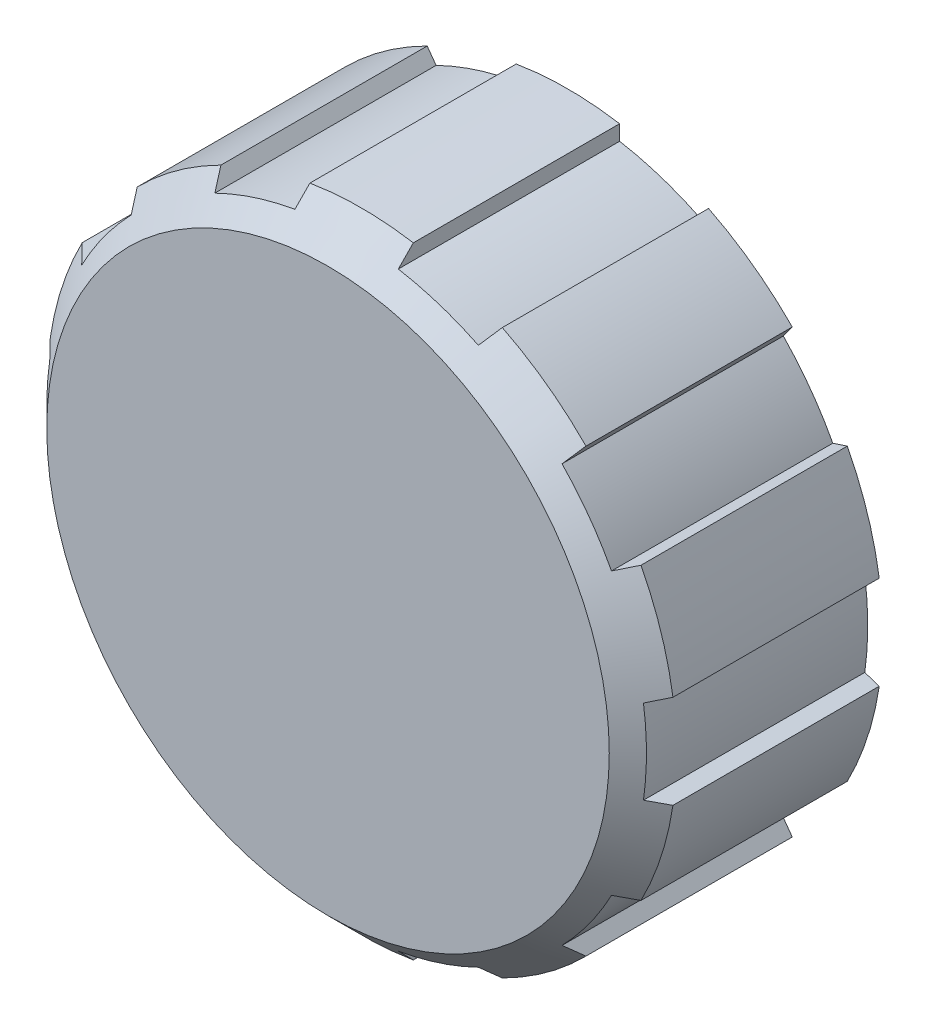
ISO-10303-21;
HEADER;
FILE_DESCRIPTION(('STEP AP214'),'2;1');
FILE_NAME('part.step','',(''),(''),'','','');
FILE_SCHEMA(('AUTOMOTIVE_DESIGN { 1 0 10303 214 1 1 1 1 }'));
ENDSEC;
DATA;
#1=APPLICATION_CONTEXT('core data for automotive mechanical design processes');
#2=APPLICATION_PROTOCOL_DEFINITION('international standard','automotive_design',2000,#1);
#3=PRODUCT_CONTEXT('',#1,'mechanical');
#4=PRODUCT('Part','Part','',(#3));
#5=PRODUCT_RELATED_PRODUCT_CATEGORY('part','',(#4));
#6=PRODUCT_DEFINITION_FORMATION('','',#4);
#7=PRODUCT_DEFINITION_CONTEXT('part definition',#1,'design');
#8=PRODUCT_DEFINITION('design','',#6,#7);
#9=PRODUCT_DEFINITION_SHAPE('','',#8);
#10=(LENGTH_UNIT() NAMED_UNIT(*) SI_UNIT(.MILLI.,.METRE.));
#11=(NAMED_UNIT(*) PLANE_ANGLE_UNIT() SI_UNIT($,.RADIAN.));
#12=(NAMED_UNIT(*) SI_UNIT($,.STERADIAN.) SOLID_ANGLE_UNIT());
#13=UNCERTAINTY_MEASURE_WITH_UNIT(LENGTH_MEASURE(1.E-05),#10,'distance_accuracy_value','');
#14=(GEOMETRIC_REPRESENTATION_CONTEXT(3) GLOBAL_UNCERTAINTY_ASSIGNED_CONTEXT((#13)) GLOBAL_UNIT_ASSIGNED_CONTEXT((#10,
#11,#12)) REPRESENTATION_CONTEXT('',''));
#15=CARTESIAN_POINT('',(0.,0.,0.));
#16=DIRECTION('',(0.,0.,1.));
#17=DIRECTION('',(1.,0.,0.));
#18=AXIS2_PLACEMENT_3D('',#15,#16,#17);
#19=CARTESIAN_POINT('',(0.,0.,16.));
#20=DIRECTION('',(0.,0.,1.));
#21=DIRECTION('',(1.,0.,0.));
#22=AXIS2_PLACEMENT_3D('',#19,#20,#21);
#23=CYLINDRICAL_SURFACE('',#22,21.);
#24=CARTESIAN_POINT('',(0.,0.,13.76));
#25=DIRECTION('',(0.,0.,1.));
#26=DIRECTION('',(1.,0.,0.));
#27=AXIS2_PLACEMENT_3D('',#24,#25,#26);
#28=CIRCLE('',#27,21.);
#29=CARTESIAN_POINT('',(-18.6347120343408,9.6823296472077,13.76));
#30=VERTEX_POINT('',#29);
#31=CARTESIAN_POINT('',(-20.7669292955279,3.12003968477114,13.76));
#32=VERTEX_POINT('',#31);
#33=EDGE_CURVE('E562',#30,#32,#28,.T.);
#34=ORIENTED_EDGE('',*,*,#33,.F.);
#35=DIRECTION('',(0.,0.,-1.));
#36=VECTOR('',#35,1.);
#37=CARTESIAN_POINT('',(-18.6347120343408,9.6823296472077,32.));
#38=LINE('',#37,#36);
#39=CARTESIAN_POINT('',(-18.6347120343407,9.6823296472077,0.));
#40=VERTEX_POINT('',#39);
#41=EDGE_CURVE('E303',#30,#40,#38,.T.);
#42=ORIENTED_EDGE('',*,*,#41,.T.);
#43=CARTESIAN_POINT('',(0.,0.,0.));
#44=DIRECTION('',(0.,0.,1.));
#45=DIRECTION('',(1.,0.,0.));
#46=AXIS2_PLACEMENT_3D('',#43,#44,#45);
#47=CIRCLE('',#46,21.);
#48=CARTESIAN_POINT('',(-20.7669292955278,3.12003968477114,0.));
#49=VERTEX_POINT('',#48);
#50=EDGE_CURVE('E296',#40,#49,#47,.T.);
#51=ORIENTED_EDGE('',*,*,#50,.T.);
#52=DIRECTION('',(0.,0.,-1.));
#53=VECTOR('',#52,1.);
#54=CARTESIAN_POINT('',(-20.7669292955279,3.12003968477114,32.));
#55=LINE('',#54,#53);
#56=EDGE_CURVE('E277',#32,#49,#55,.T.);
#57=ORIENTED_EDGE('',*,*,#56,.F.);
#58=EDGE_LOOP('',(#34,#42,#51,#57));
#59=FACE_BOUND('',#58,.T.);
#60=ADVANCED_FACE('F14',(#59),#23,.T.);
#61=CARTESIAN_POINT('',(-9.38466814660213,18.786378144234,0.));
#62=VERTEX_POINT('',#61);
#63=CARTESIAN_POINT('',(-14.9668854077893,14.7306599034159,0.));
#64=VERTEX_POINT('',#63);
#65=EDGE_CURVE('E304',#62,#64,#47,.T.);
#66=ORIENTED_EDGE('',*,*,#65,.T.);
#67=DIRECTION('',(0.,0.,-1.));
#68=VECTOR('',#67,1.);
#69=CARTESIAN_POINT('',(-14.9668854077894,14.7306599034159,32.));
#70=LINE('',#69,#68);
#71=CARTESIAN_POINT('',(-14.9668854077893,14.7306599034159,13.76));
#72=VERTEX_POINT('',#71);
#73=EDGE_CURVE('E470',#72,#64,#70,.T.);
#74=ORIENTED_EDGE('',*,*,#73,.F.);
#75=CARTESIAN_POINT('',(-9.38466814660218,18.786378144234,13.76));
#76=VERTEX_POINT('',#75);
#77=EDGE_CURVE('E556',#76,#72,#28,.T.);
#78=ORIENTED_EDGE('',*,*,#77,.F.);
#79=DIRECTION('',(0.,0.,-1.));
#80=VECTOR('',#79,1.);
#81=CARTESIAN_POINT('',(-9.38466814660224,18.786378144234,32.));
#82=LINE('',#81,#80);
#83=EDGE_CURVE('E472',#76,#62,#82,.T.);
#84=ORIENTED_EDGE('',*,*,#83,.T.);
#85=EDGE_LOOP('',(#66,#74,#78,#84));
#86=FACE_BOUND('',#85,.T.);
#87=ADVANCED_FACE('F352',(#86),#23,.T.);
#88=CARTESIAN_POINT('',(14.9668854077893,14.7306599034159,0.));
#89=VERTEX_POINT('',#88);
#90=CARTESIAN_POINT('',(9.38466814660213,18.786378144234,0.));
#91=VERTEX_POINT('',#90);
#92=EDGE_CURVE('E315',#89,#91,#47,.T.);
#93=ORIENTED_EDGE('',*,*,#92,.T.);
#94=DIRECTION('',(0.,0.,-1.));
#95=VECTOR('',#94,1.);
#96=CARTESIAN_POINT('',(9.38466814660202,18.786378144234,32.));
#97=LINE('',#96,#95);
#98=CARTESIAN_POINT('',(9.38466814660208,18.786378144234,13.76));
#99=VERTEX_POINT('',#98);
#100=EDGE_CURVE('E487',#99,#91,#97,.T.);
#101=ORIENTED_EDGE('',*,*,#100,.F.);
#102=CARTESIAN_POINT('',(14.9668854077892,14.7306599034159,13.76));
#103=VERTEX_POINT('',#102);
#104=EDGE_CURVE('E545',#103,#99,#28,.T.);
#105=ORIENTED_EDGE('',*,*,#104,.F.);
#106=DIRECTION('',(0.,0.,-1.));
#107=VECTOR('',#106,1.);
#108=CARTESIAN_POINT('',(14.9668854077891,14.7306599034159,32.));
#109=LINE('',#108,#107);
#110=EDGE_CURVE('E489',#103,#89,#109,.T.);
#111=ORIENTED_EDGE('',*,*,#110,.T.);
#112=EDGE_LOOP('',(#93,#101,#105,#111));
#113=FACE_BOUND('',#112,.T.);
#114=ADVANCED_FACE('F357',(#113),#23,.T.);
#115=CARTESIAN_POINT('',(20.7669292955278,3.12003968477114,0.));
#116=VERTEX_POINT('',#115);
#117=CARTESIAN_POINT('',(18.6347120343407,9.68232964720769,0.));
#118=VERTEX_POINT('',#117);
#119=EDGE_CURVE('E560',#116,#118,#47,.T.);
#120=ORIENTED_EDGE('',*,*,#119,.T.);
#121=DIRECTION('',(0.,0.,-1.));
#122=VECTOR('',#121,1.);
#123=CARTESIAN_POINT('',(18.6347120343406,9.68232964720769,32.));
#124=LINE('',#123,#122);
#125=CARTESIAN_POINT('',(18.6347120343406,9.68232964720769,13.7600000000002));
#126=VERTEX_POINT('',#125);
#127=EDGE_CURVE('E496',#126,#118,#124,.T.);
#128=ORIENTED_EDGE('',*,*,#127,.F.);
#129=CARTESIAN_POINT('',(20.7669292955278,3.12003968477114,13.76));
#130=VERTEX_POINT('',#129);
#131=EDGE_CURVE('E548',#130,#126,#28,.T.);
#132=ORIENTED_EDGE('',*,*,#131,.F.);
#133=DIRECTION('',(0.,0.,-1.));
#134=VECTOR('',#133,1.);
#135=CARTESIAN_POINT('',(20.7669292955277,3.12003968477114,32.));
#136=LINE('',#135,#134);
#137=EDGE_CURVE('E498',#130,#116,#136,.T.);
#138=ORIENTED_EDGE('',*,*,#137,.T.);
#139=EDGE_LOOP('',(#120,#128,#132,#138));
#140=FACE_BOUND('',#139,.T.);
#141=ADVANCED_FACE('F1023',(#140),#23,.T.);
#142=CARTESIAN_POINT('',(18.6347120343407,-9.68232964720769,0.));
#143=VERTEX_POINT('',#142);
#144=CARTESIAN_POINT('',(20.7669292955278,-3.12003968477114,0.));
#145=VERTEX_POINT('',#144);
#146=EDGE_CURVE('E598',#143,#145,#47,.T.);
#147=ORIENTED_EDGE('',*,*,#146,.T.);
#148=DIRECTION('',(0.,0.,-1.));
#149=VECTOR('',#148,1.);
#150=CARTESIAN_POINT('',(20.7669292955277,-3.12003968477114,32.));
#151=LINE('',#150,#149);
#152=CARTESIAN_POINT('',(20.7669292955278,-3.12003968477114,13.7600000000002));
#153=VERTEX_POINT('',#152);
#154=EDGE_CURVE('E505',#153,#145,#151,.T.);
#155=ORIENTED_EDGE('',*,*,#154,.F.);
#156=CARTESIAN_POINT('',(18.6347120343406,-9.68232964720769,13.76));
#157=VERTEX_POINT('',#156);
#158=EDGE_CURVE('E554',#157,#153,#28,.T.);
#159=ORIENTED_EDGE('',*,*,#158,.F.);
#160=DIRECTION('',(0.,0.,-1.));
#161=VECTOR('',#160,1.);
#162=CARTESIAN_POINT('',(18.6347120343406,-9.68232964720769,32.));
#163=LINE('',#162,#161);
#164=EDGE_CURVE('E507',#157,#143,#163,.T.);
#165=ORIENTED_EDGE('',*,*,#164,.T.);
#166=EDGE_LOOP('',(#147,#155,#159,#165));
#167=FACE_BOUND('',#166,.T.);
#168=ADVANCED_FACE('F596',(#167),#23,.T.);
#169=CARTESIAN_POINT('',(9.38466814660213,-18.786378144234,0.));
#170=VERTEX_POINT('',#169);
#171=CARTESIAN_POINT('',(14.9668854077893,-14.7306599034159,0.));
#172=VERTEX_POINT('',#171);
#173=EDGE_CURVE('E717',#170,#172,#47,.T.);
#174=ORIENTED_EDGE('',*,*,#173,.T.);
#175=DIRECTION('',(0.,0.,-1.));
#176=VECTOR('',#175,1.);
#177=CARTESIAN_POINT('',(14.9668854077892,-14.7306599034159,32.));
#178=LINE('',#177,#176);
#179=CARTESIAN_POINT('',(14.9668854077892,-14.7306599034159,13.7600000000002));
#180=VERTEX_POINT('',#179);
#181=EDGE_CURVE('E514',#180,#172,#178,.T.);
#182=ORIENTED_EDGE('',*,*,#181,.F.);
#183=CARTESIAN_POINT('',(9.38466814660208,-18.786378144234,13.76));
#184=VERTEX_POINT('',#183);
#185=EDGE_CURVE('E576',#184,#180,#28,.T.);
#186=ORIENTED_EDGE('',*,*,#185,.F.);
#187=DIRECTION('',(0.,0.,-1.));
#188=VECTOR('',#187,1.);
#189=CARTESIAN_POINT('',(9.38466814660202,-18.786378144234,32.));
#190=LINE('',#189,#188);
#191=EDGE_CURVE('E516',#184,#170,#190,.T.);
#192=ORIENTED_EDGE('',*,*,#191,.T.);
#193=EDGE_LOOP('',(#174,#182,#186,#192));
#194=FACE_BOUND('',#193,.T.);
#195=ADVANCED_FACE('F715',(#194),#23,.T.);
#196=CARTESIAN_POINT('',(-3.45,-20.714668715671,0.));
#197=VERTEX_POINT('',#196);
#198=CARTESIAN_POINT('',(3.45,-20.714668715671,0.));
#199=VERTEX_POINT('',#198);
#200=EDGE_CURVE('E1132',#197,#199,#47,.T.);
#201=ORIENTED_EDGE('',*,*,#200,.T.);
#202=DIRECTION('',(0.,0.,-1.));
#203=VECTOR('',#202,1.);
#204=CARTESIAN_POINT('',(3.44999999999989,-20.714668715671,32.));
#205=LINE('',#204,#203);
#206=CARTESIAN_POINT('',(3.44999999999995,-20.714668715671,13.7600000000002));
#207=VERTEX_POINT('',#206);
#208=EDGE_CURVE('E523',#207,#199,#205,.T.);
#209=ORIENTED_EDGE('',*,*,#208,.F.);
#210=CARTESIAN_POINT('',(-3.45000000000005,-20.714668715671,13.76));
#211=VERTEX_POINT('',#210);
#212=EDGE_CURVE('E571',#211,#207,#28,.T.);
#213=ORIENTED_EDGE('',*,*,#212,.F.);
#214=DIRECTION('',(0.,0.,-1.));
#215=VECTOR('',#214,1.);
#216=CARTESIAN_POINT('',(-3.45000000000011,-20.714668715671,32.));
#217=LINE('',#216,#215);
#218=EDGE_CURVE('E525',#211,#197,#217,.T.);
#219=ORIENTED_EDGE('',*,*,#218,.T.);
#220=EDGE_LOOP('',(#201,#209,#213,#219));
#221=FACE_BOUND('',#220,.T.);
#222=ADVANCED_FACE('F378',(#221),#23,.T.);
#223=CARTESIAN_POINT('',(-14.9668854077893,-14.7306599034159,0.));
#224=VERTEX_POINT('',#223);
#225=CARTESIAN_POINT('',(-9.38466814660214,-18.786378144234,0.));
#226=VERTEX_POINT('',#225);
#227=EDGE_CURVE('E310',#224,#226,#47,.T.);
#228=ORIENTED_EDGE('',*,*,#227,.T.);
#229=DIRECTION('',(0.,0.,-1.));
#230=VECTOR('',#229,1.);
#231=CARTESIAN_POINT('',(-9.38466814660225,-18.786378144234,32.));
#232=LINE('',#231,#230);
#233=CARTESIAN_POINT('',(-9.38466814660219,-18.786378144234,13.76));
#234=VERTEX_POINT('',#233);
#235=EDGE_CURVE('E532',#234,#226,#232,.T.);
#236=ORIENTED_EDGE('',*,*,#235,.F.);
#237=CARTESIAN_POINT('',(-14.9668854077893,-14.7306599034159,13.76));
#238=VERTEX_POINT('',#237);
#239=EDGE_CURVE('E567',#238,#234,#28,.T.);
#240=ORIENTED_EDGE('',*,*,#239,.F.);
#241=DIRECTION('',(0.,0.,-1.));
#242=VECTOR('',#241,1.);
#243=CARTESIAN_POINT('',(-14.9668854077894,-14.7306599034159,32.));
#244=LINE('',#243,#242);
#245=EDGE_CURVE('E534',#238,#224,#244,.T.);
#246=ORIENTED_EDGE('',*,*,#245,.T.);
#247=EDGE_LOOP('',(#228,#236,#240,#246));
#248=FACE_BOUND('',#247,.T.);
#249=ADVANCED_FACE('F370',(#248),#23,.T.);
#250=CARTESIAN_POINT('',(-20.7669292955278,-3.12003968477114,0.));
#251=VERTEX_POINT('',#250);
#252=CARTESIAN_POINT('',(-18.6347120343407,-9.68232964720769,0.));
#253=VERTEX_POINT('',#252);
#254=EDGE_CURVE('E305',#251,#253,#47,.T.);
#255=ORIENTED_EDGE('',*,*,#254,.T.);
#256=DIRECTION('',(0.,0.,-1.));
#257=VECTOR('',#256,1.);
#258=CARTESIAN_POINT('',(-18.6347120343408,-9.68232964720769,32.));
#259=LINE('',#258,#257);
#260=CARTESIAN_POINT('',(-18.6347120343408,-9.68232964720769,13.76));
#261=VERTEX_POINT('',#260);
#262=EDGE_CURVE('E384',#261,#253,#259,.T.);
#263=ORIENTED_EDGE('',*,*,#262,.F.);
#264=CARTESIAN_POINT('',(-20.7669292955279,-3.12003968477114,13.76));
#265=VERTEX_POINT('',#264);
#266=EDGE_CURVE('E566',#265,#261,#28,.T.);
#267=ORIENTED_EDGE('',*,*,#266,.F.);
#268=DIRECTION('',(0.,0.,-1.));
#269=VECTOR('',#268,1.);
#270=CARTESIAN_POINT('',(-20.7669292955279,-3.12003968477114,32.));
#271=LINE('',#270,#269);
#272=EDGE_CURVE('E386',#265,#251,#271,.T.);
#273=ORIENTED_EDGE('',*,*,#272,.T.);
#274=EDGE_LOOP('',(#255,#263,#267,#273));
#275=FACE_BOUND('',#274,.T.);
#276=ADVANCED_FACE('F362',(#275),#23,.T.);
#277=CARTESIAN_POINT('',(0.,16.6245,2.));
#278=DIRECTION('',(0.,0.,1.));
#279=DIRECTION('',(1.,0.,0.));
#280=AXIS2_PLACEMENT_3D('',#277,#278,#279);
#281=PLANE('',#280);
#282=CARTESIAN_POINT('',(0.,0.,2.));
#283=DIRECTION('',(0.,0.,1.));
#284=DIRECTION('',(1.,0.,0.));
#285=AXIS2_PLACEMENT_3D('',#282,#283,#284);
#286=CIRCLE('',#285,17.1245);
#287=CARTESIAN_POINT('',(17.1245,0.,2.00000000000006));
#288=VERTEX_POINT('',#287);
#289=EDGE_CURVE('E320',#288,#288,#286,.T.);
#290=ORIENTED_EDGE('',*,*,#289,.F.);
#291=EDGE_LOOP('',(#290));
#292=FACE_BOUND('',#291,.T.);
#293=CARTESIAN_POINT('',(0.,0.,2.));
#294=DIRECTION('',(0.,0.,-1.));
#295=DIRECTION('',(-1.,0.,0.));
#296=AXIS2_PLACEMENT_3D('',#293,#294,#295);
#297=CIRCLE('',#296,16.6245);
#298=CARTESIAN_POINT('',(-16.6245,0.,1.99999999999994));
#299=VERTEX_POINT('',#298);
#300=EDGE_CURVE('E1183',#299,#299,#297,.T.);
#301=ORIENTED_EDGE('',*,*,#300,.F.);
#302=EDGE_LOOP('',(#301));
#303=FACE_BOUND('',#302,.T.);
#304=ADVANCED_FACE('F369',(#292,#303),#281,.F.);
#305=CARTESIAN_POINT('',(0.,0.,16.));
#306=DIRECTION('',(0.,0.,1.));
#307=DIRECTION('',(1.,0.,0.));
#308=AXIS2_PLACEMENT_3D('',#305,#306,#307);
#309=CYLINDRICAL_SURFACE('',#308,17.1245);
#310=CARTESIAN_POINT('',(0.,0.,0.));
#311=DIRECTION('',(0.,0.,1.));
#312=DIRECTION('',(1.,0.,0.));
#313=AXIS2_PLACEMENT_3D('',#310,#311,#312);
#314=CIRCLE('',#313,17.1245);
#315=CARTESIAN_POINT('',(17.1245,0.,0.));
#316=VERTEX_POINT('',#315);
#317=EDGE_CURVE('E314',#316,#316,#314,.T.);
#318=ORIENTED_EDGE('',*,*,#317,.F.);
#319=EDGE_LOOP('',(#318));
#320=FACE_BOUND('',#319,.T.);
#321=ORIENTED_EDGE('',*,*,#289,.T.);
#322=EDGE_LOOP('',(#321));
#323=FACE_BOUND('',#322,.T.);
#324=ADVANCED_FACE('F367',(#320,#323),#309,.F.);
#325=CARTESIAN_POINT('',(0.,17.1245,0.));
#326=DIRECTION('',(0.,0.,1.));
#327=DIRECTION('',(1.,0.,0.));
#328=AXIS2_PLACEMENT_3D('',#325,#326,#327);
#329=PLANE('',#328);
#330=CARTESIAN_POINT('',(3.45,20.714668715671,0.));
#331=VERTEX_POINT('',#330);
#332=CARTESIAN_POINT('',(-3.45,20.714668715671,0.));
#333=VERTEX_POINT('',#332);
#334=EDGE_CURVE('E308',#331,#333,#47,.T.);
#335=ORIENTED_EDGE('',*,*,#334,.F.);
#336=DIRECTION('',(0.,1.,0.));
#337=VECTOR('',#336,1.);
#338=CARTESIAN_POINT('',(3.45,19.7001903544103,0.));
#339=LINE('',#338,#337);
#340=CARTESIAN_POINT('',(3.45,19.7001903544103,0.));
#341=VERTEX_POINT('',#340);
#342=EDGE_CURVE('E449',#341,#331,#339,.T.);
#343=ORIENTED_EDGE('',*,*,#342,.F.);
#344=CARTESIAN_POINT('',(0.,0.,0.));
#345=DIRECTION('',(0.,0.,1.));
#346=DIRECTION('',(1.,0.,0.));
#347=AXIS2_PLACEMENT_3D('',#344,#345,#346);
#348=CIRCLE('',#347,20.);
#349=CARTESIAN_POINT('',(8.78837272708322,17.9656479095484,0.));
#350=VERTEX_POINT('',#349);
#351=EDGE_CURVE('E446',#350,#341,#348,.T.);
#352=ORIENTED_EDGE('',*,*,#351,.F.);
#353=DIRECTION('',(-0.587785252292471,-0.809016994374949,0.));
#354=VECTOR('',#353,1.);
#355=CARTESIAN_POINT('',(9.38466814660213,18.786378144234,0.));
#356=LINE('',#355,#354);
#357=EDGE_CURVE('E443',#91,#350,#356,.T.);
#358=ORIENTED_EDGE('',*,*,#357,.F.);
#359=ORIENTED_EDGE('',*,*,#92,.F.);
#360=DIRECTION('',(0.58778525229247,0.80901699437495,0.));
#361=VECTOR('',#360,1.);
#362=CARTESIAN_POINT('',(14.3705899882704,13.9099296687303,0.));
#363=LINE('',#362,#361);
#364=CARTESIAN_POINT('',(14.3705899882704,13.9099296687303,0.));
#365=VERTEX_POINT('',#364);
#366=EDGE_CURVE('E441',#365,#89,#363,.T.);
#367=ORIENTED_EDGE('',*,*,#366,.F.);
#368=CARTESIAN_POINT('',(0.,0.,0.));
#369=DIRECTION('',(0.,0.,1.));
#370=DIRECTION('',(1.,0.,0.));
#371=AXIS2_PLACEMENT_3D('',#368,#369,#370);
#372=CIRCLE('',#371,20.);
#373=CARTESIAN_POINT('',(17.6698857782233,9.36883859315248,0.));
#374=VERTEX_POINT('',#373);
#375=EDGE_CURVE('E438',#374,#365,#372,.T.);
#376=ORIENTED_EDGE('',*,*,#375,.F.);
#377=DIRECTION('',(-0.951056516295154,-0.309016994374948,0.));
#378=VECTOR('',#377,1.);
#379=CARTESIAN_POINT('',(18.6347120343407,9.6823296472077,0.));
#380=LINE('',#379,#378);
#381=EDGE_CURVE('E435',#118,#374,#380,.T.);
#382=ORIENTED_EDGE('',*,*,#381,.F.);
#383=ORIENTED_EDGE('',*,*,#119,.F.);
#384=DIRECTION('',(0.951056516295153,0.309016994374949,0.));
#385=VECTOR('',#384,1.);
#386=CARTESIAN_POINT('',(19.8021030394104,2.80654863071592,0.));
#387=LINE('',#386,#385);
#388=CARTESIAN_POINT('',(19.8021030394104,2.80654863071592,0.));
#389=VERTEX_POINT('',#388);
#390=EDGE_CURVE('E433',#389,#116,#387,.T.);
#391=ORIENTED_EDGE('',*,*,#390,.F.);
#392=CARTESIAN_POINT('',(2.53269627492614E-13,0.,0.));
#393=DIRECTION('',(0.,0.,1.));
#394=DIRECTION('',(1.,0.,0.));
#395=AXIS2_PLACEMENT_3D('',#392,#393,#394);
#396=CIRCLE('',#395,19.9999999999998);
#397=CARTESIAN_POINT('',(19.8021030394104,-2.80654863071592,0.));
#398=VERTEX_POINT('',#397);
#399=EDGE_CURVE('E430',#398,#389,#396,.T.);
#400=ORIENTED_EDGE('',*,*,#399,.F.);
#401=DIRECTION('',(-0.951056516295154,0.309016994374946,0.));
#402=VECTOR('',#401,1.);
#403=CARTESIAN_POINT('',(20.7669292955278,-3.12003968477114,0.));
#404=LINE('',#403,#402);
#405=EDGE_CURVE('E427',#145,#398,#404,.T.);
#406=ORIENTED_EDGE('',*,*,#405,.F.);
#407=ORIENTED_EDGE('',*,*,#146,.F.);
#408=DIRECTION('',(0.951056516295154,-0.309016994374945,0.));
#409=VECTOR('',#408,1.);
#410=CARTESIAN_POINT('',(17.6698857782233,-9.36883859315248,0.));
#411=LINE('',#410,#409);
#412=CARTESIAN_POINT('',(17.6698857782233,-9.36883859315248,0.));
#413=VERTEX_POINT('',#412);
#414=EDGE_CURVE('E425',#413,#143,#411,.T.);
#415=ORIENTED_EDGE('',*,*,#414,.F.);
#416=CARTESIAN_POINT('',(0.,0.,0.));
#417=DIRECTION('',(0.,0.,1.));
#418=DIRECTION('',(1.,0.,0.));
#419=AXIS2_PLACEMENT_3D('',#416,#417,#418);
#420=CIRCLE('',#419,20.);
#421=CARTESIAN_POINT('',(14.3705899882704,-13.9099296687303,0.));
#422=VERTEX_POINT('',#421);
#423=EDGE_CURVE('E422',#422,#413,#420,.T.);
#424=ORIENTED_EDGE('',*,*,#423,.F.);
#425=DIRECTION('',(-0.587785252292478,0.809016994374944,0.));
#426=VECTOR('',#425,1.);
#427=CARTESIAN_POINT('',(14.9668854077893,-14.7306599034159,0.));
#428=LINE('',#427,#426);
#429=EDGE_CURVE('E419',#172,#422,#428,.T.);
#430=ORIENTED_EDGE('',*,*,#429,.F.);
#431=ORIENTED_EDGE('',*,*,#173,.F.);
#432=DIRECTION('',(0.587785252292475,-0.809016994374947,0.));
#433=VECTOR('',#432,1.);
#434=CARTESIAN_POINT('',(8.78837272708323,-17.9656479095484,0.));
#435=LINE('',#434,#433);
#436=CARTESIAN_POINT('',(8.78837272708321,-17.9656479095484,0.));
#437=VERTEX_POINT('',#436);
#438=EDGE_CURVE('E417',#437,#170,#435,.T.);
#439=ORIENTED_EDGE('',*,*,#438,.F.);
#440=CARTESIAN_POINT('',(0.,0.,0.));
#441=DIRECTION('',(0.,0.,1.));
#442=DIRECTION('',(1.,0.,0.));
#443=AXIS2_PLACEMENT_3D('',#440,#441,#442);
#444=CIRCLE('',#443,20.);
#445=CARTESIAN_POINT('',(3.45,-19.7001903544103,0.));
#446=VERTEX_POINT('',#445);
#447=EDGE_CURVE('E414',#446,#437,#444,.T.);
#448=ORIENTED_EDGE('',*,*,#447,.F.);
#449=DIRECTION('',(0.,1.,0.));
#450=VECTOR('',#449,1.);
#451=CARTESIAN_POINT('',(3.45,-20.714668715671,0.));
#452=LINE('',#451,#450);
#453=EDGE_CURVE('E411',#199,#446,#452,.T.);
#454=ORIENTED_EDGE('',*,*,#453,.F.);
#455=ORIENTED_EDGE('',*,*,#200,.F.);
#456=DIRECTION('',(0.,-1.,0.));
#457=VECTOR('',#456,1.);
#458=CARTESIAN_POINT('',(-3.45,-19.7001903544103,0.));
#459=LINE('',#458,#457);
#460=CARTESIAN_POINT('',(-3.45,-19.7001903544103,0.));
#461=VERTEX_POINT('',#460);
#462=EDGE_CURVE('E409',#461,#197,#459,.T.);
#463=ORIENTED_EDGE('',*,*,#462,.F.);
#464=CARTESIAN_POINT('',(0.,-2.18575157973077E-13,0.));
#465=DIRECTION('',(0.,0.,1.));
#466=DIRECTION('',(1.,0.,0.));
#467=AXIS2_PLACEMENT_3D('',#464,#465,#466);
#468=CIRCLE('',#467,20.);
#469=CARTESIAN_POINT('',(-8.78837272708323,-17.9656479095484,0.));
#470=VERTEX_POINT('',#469);
#471=EDGE_CURVE('E406',#470,#461,#468,.T.);
#472=ORIENTED_EDGE('',*,*,#471,.F.);
#473=DIRECTION('',(0.587785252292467,0.809016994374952,0.));
#474=VECTOR('',#473,1.);
#475=CARTESIAN_POINT('',(-9.38466814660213,-18.786378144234,0.));
#476=LINE('',#475,#474);
#477=EDGE_CURVE('E403',#226,#470,#476,.T.);
#478=ORIENTED_EDGE('',*,*,#477,.F.);
#479=ORIENTED_EDGE('',*,*,#227,.F.);
#480=DIRECTION('',(-0.587785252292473,-0.809016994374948,0.));
#481=VECTOR('',#480,1.);
#482=CARTESIAN_POINT('',(-14.3705899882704,-13.9099296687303,0.));
#483=LINE('',#482,#481);
#484=CARTESIAN_POINT('',(-14.3705899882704,-13.9099296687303,0.));
#485=VERTEX_POINT('',#484);
#486=EDGE_CURVE('E397',#485,#224,#483,.T.);
#487=ORIENTED_EDGE('',*,*,#486,.F.);
#488=CARTESIAN_POINT('',(2.67147415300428E-13,1.83880688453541E-13,0.));
#489=DIRECTION('',(0.,0.,1.));
#490=DIRECTION('',(1.,0.,0.));
#491=AXIS2_PLACEMENT_3D('',#488,#489,#490);
#492=CIRCLE('',#491,20.0000000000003);
#493=CARTESIAN_POINT('',(-17.6698857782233,-9.36883859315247,0.));
#494=VERTEX_POINT('',#493);
#495=EDGE_CURVE('E394',#494,#485,#492,.T.);
#496=ORIENTED_EDGE('',*,*,#495,.F.);
#497=DIRECTION('',(0.951056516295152,0.309016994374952,0.));
#498=VECTOR('',#497,1.);
#499=CARTESIAN_POINT('',(-18.6347120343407,-9.6823296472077,0.));
#500=LINE('',#499,#498);
#501=EDGE_CURVE('E391',#253,#494,#500,.T.);
#502=ORIENTED_EDGE('',*,*,#501,.F.);
#503=ORIENTED_EDGE('',*,*,#254,.F.);
#504=DIRECTION('',(-0.951056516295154,-0.309016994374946,0.));
#505=VECTOR('',#504,1.);
#506=CARTESIAN_POINT('',(-19.8021030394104,-2.80654863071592,0.));
#507=LINE('',#506,#505);
#508=CARTESIAN_POINT('',(-19.8021030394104,-2.80654863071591,0.));
#509=VERTEX_POINT('',#508);
#510=EDGE_CURVE('E388',#509,#251,#507,.T.);
#511=ORIENTED_EDGE('',*,*,#510,.F.);
#512=CARTESIAN_POINT('',(-2.22044604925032E-13,0.,0.));
#513=DIRECTION('',(0.,0.,1.));
#514=DIRECTION('',(1.,0.,0.));
#515=AXIS2_PLACEMENT_3D('',#512,#513,#514);
#516=CIRCLE('',#515,20.);
#517=CARTESIAN_POINT('',(-19.8021030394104,2.80654863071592,0.));
#518=VERTEX_POINT('',#517);
#519=EDGE_CURVE('E299',#518,#509,#516,.T.);
#520=ORIENTED_EDGE('',*,*,#519,.F.);
#521=DIRECTION('',(0.951056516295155,-0.309016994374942,0.));
#522=VECTOR('',#521,1.);
#523=CARTESIAN_POINT('',(-20.7669292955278,3.12003968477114,0.));
#524=LINE('',#523,#522);
#525=EDGE_CURVE('E280',#49,#518,#524,.T.);
#526=ORIENTED_EDGE('',*,*,#525,.F.);
#527=ORIENTED_EDGE('',*,*,#50,.F.);
#528=DIRECTION('',(-0.951056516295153,0.30901699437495,0.));
#529=VECTOR('',#528,1.);
#530=CARTESIAN_POINT('',(-17.6698857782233,9.36883859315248,0.));
#531=LINE('',#530,#529);
#532=CARTESIAN_POINT('',(-17.6698857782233,9.36883859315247,0.));
#533=VERTEX_POINT('',#532);
#534=EDGE_CURVE('E289',#533,#40,#531,.T.);
#535=ORIENTED_EDGE('',*,*,#534,.F.);
#536=CARTESIAN_POINT('',(0.,0.,0.));
#537=DIRECTION('',(0.,0.,1.));
#538=DIRECTION('',(1.,0.,0.));
#539=AXIS2_PLACEMENT_3D('',#536,#537,#538);
#540=CIRCLE('',#539,20.);
#541=CARTESIAN_POINT('',(-14.3705899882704,13.9099296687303,0.));
#542=VERTEX_POINT('',#541);
#543=EDGE_CURVE('E461',#542,#533,#540,.T.);
#544=ORIENTED_EDGE('',*,*,#543,.F.);
#545=DIRECTION('',(0.587785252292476,-0.809016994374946,0.));
#546=VECTOR('',#545,1.);
#547=CARTESIAN_POINT('',(-14.9668854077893,14.7306599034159,0.));
#548=LINE('',#547,#546);
#549=EDGE_CURVE('E459',#64,#542,#548,.T.);
#550=ORIENTED_EDGE('',*,*,#549,.F.);
#551=ORIENTED_EDGE('',*,*,#65,.F.);
#552=DIRECTION('',(-0.587785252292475,0.809016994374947,0.));
#553=VECTOR('',#552,1.);
#554=CARTESIAN_POINT('',(-8.78837272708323,17.9656479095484,0.));
#555=LINE('',#554,#553);
#556=CARTESIAN_POINT('',(-8.78837272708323,17.9656479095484,0.));
#557=VERTEX_POINT('',#556);
#558=EDGE_CURVE('E457',#557,#62,#555,.T.);
#559=ORIENTED_EDGE('',*,*,#558,.F.);
#560=CARTESIAN_POINT('',(0.,0.,0.));
#561=DIRECTION('',(0.,0.,1.));
#562=DIRECTION('',(1.,0.,0.));
#563=AXIS2_PLACEMENT_3D('',#560,#561,#562);
#564=CIRCLE('',#563,20.);
#565=CARTESIAN_POINT('',(-3.45,19.7001903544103,0.));
#566=VERTEX_POINT('',#565);
#567=EDGE_CURVE('E454',#566,#557,#564,.T.);
#568=ORIENTED_EDGE('',*,*,#567,.F.);
#569=DIRECTION('',(0.,-1.,0.));
#570=VECTOR('',#569,1.);
#571=CARTESIAN_POINT('',(-3.45,20.714668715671,0.));
#572=LINE('',#571,#570);
#573=EDGE_CURVE('E452',#333,#566,#572,.T.);
#574=ORIENTED_EDGE('',*,*,#573,.F.);
#575=EDGE_LOOP('',(#335,#343,#352,#358,#359,#367,#376,#382,#383,#391,#400,#406,#407,#415,#424,
#430,#431,#439,#448,#454,#455,#463,#472,#478,#479,#487,#496,#502,#503,#511,#520,#526,#527,#535,
#544,#550,#551,#559,#568,#574));
#576=FACE_BOUND('',#575,.T.);
#577=ORIENTED_EDGE('',*,*,#317,.T.);
#578=EDGE_LOOP('',(#577));
#579=FACE_BOUND('',#578,.T.);
#580=ADVANCED_FACE('F293',(#576,#579),#329,.F.);
#581=ORIENTED_EDGE('',*,*,#334,.T.);
#582=DIRECTION('',(0.,0.,-1.));
#583=VECTOR('',#582,1.);
#584=CARTESIAN_POINT('',(-3.45000000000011,20.714668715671,32.));
#585=LINE('',#584,#583);
#586=CARTESIAN_POINT('',(-3.45000000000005,20.714668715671,13.76));
#587=VERTEX_POINT('',#586);
#588=EDGE_CURVE('E478',#587,#333,#585,.T.);
#589=ORIENTED_EDGE('',*,*,#588,.F.);
#590=CARTESIAN_POINT('',(3.44999999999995,20.714668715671,13.76));
#591=VERTEX_POINT('',#590);
#592=EDGE_CURVE('E316',#591,#587,#28,.T.);
#593=ORIENTED_EDGE('',*,*,#592,.F.);
#594=DIRECTION('',(0.,0.,-1.));
#595=VECTOR('',#594,1.);
#596=CARTESIAN_POINT('',(3.44999999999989,20.714668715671,32.));
#597=LINE('',#596,#595);
#598=EDGE_CURVE('E480',#591,#331,#597,.T.);
#599=ORIENTED_EDGE('',*,*,#598,.T.);
#600=EDGE_LOOP('',(#581,#589,#593,#599));
#601=FACE_BOUND('',#600,.T.);
#602=ADVANCED_FACE('F348',(#601),#23,.T.);
#603=CARTESIAN_POINT('',(0.,0.,13.76));
#604=DIRECTION('',(0.,0.,-1.));
#605=DIRECTION('',(-1.,0.,0.));
#606=AXIS2_PLACEMENT_3D('',#603,#604,#605);
#607=CONICAL_SURFACE('',#606,21.,0.785398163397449);
#608=CARTESIAN_POINT('',(0.,0.,16.));
#609=DIRECTION('',(0.,0.,1.));
#610=DIRECTION('',(1.,0.,0.));
#611=AXIS2_PLACEMENT_3D('',#608,#609,#610);
#612=CIRCLE('',#611,18.76);
#613=CARTESIAN_POINT('',(18.7599999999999,0.,16.0000000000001));
#614=VERTEX_POINT('',#613);
#615=EDGE_CURVE('E466',#614,#614,#612,.T.);
#616=ORIENTED_EDGE('',*,*,#615,.F.);
#617=EDGE_LOOP('',(#616));
#618=FACE_BOUND('',#617,.T.);
#619=CARTESIAN_POINT('',(0.,0.,14.76));
#620=DIRECTION('',(0.,0.,-1.));
#621=DIRECTION('',(-1.,0.,0.));
#622=AXIS2_PLACEMENT_3D('',#619,#620,#621);
#623=CIRCLE('',#622,20.);
#624=CARTESIAN_POINT('',(-14.3705899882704,13.9099296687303,14.76));
#625=VERTEX_POINT('',#624);
#626=CARTESIAN_POINT('',(-17.6698857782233,9.36883859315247,14.76));
#627=VERTEX_POINT('',#626);
#628=EDGE_CURVE('E28',#625,#627,#623,.F.);
#629=ORIENTED_EDGE('',*,*,#628,.T.);
#630=CARTESIAN_POINT('',(-16.9685447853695,9.14095909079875,15.4859592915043));
#631=CARTESIAN_POINT('',(-17.2023269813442,9.21691953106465,15.2441151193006));
#632=CARTESIAN_POINT('',(-17.4360384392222,9.29285698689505,15.0021953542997));
#633=CARTESIAN_POINT('',(-17.9915413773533,9.47335083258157,14.4268617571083));
#634=CARTESIAN_POINT('',(-18.3132753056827,9.57788852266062,14.0933864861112));
#635=CARTESIAN_POINT('',(-18.6349072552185,9.68239307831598,13.7597975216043));
#636=CARTESIAN_POINT('',(-18.6349096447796,9.68239385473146,13.7597950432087));
#637=CARTESIAN_POINT('',(-19.1900271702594,9.86276247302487,13.1840404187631));
#638=CARTESIAN_POINT('',(-19.7448314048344,10.0430292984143,12.6079569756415));
#639=CARTESIAN_POINT('',(-20.2993924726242,10.2232171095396,12.0316146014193));
#640=B_SPLINE_CURVE_WITH_KNOTS('',3,(#630,#631,#632,#633,#634,#635,#636,#637,#638,#639),
.UNSPECIFIED.,.F.,.F.,(4,2,2,2,4),(0.,1.03451163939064,2.45957971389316,2.45959030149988,
4.91918033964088),.UNSPECIFIED.);
#641=EDGE_CURVE('E9',#627,#30,#640,.T.);
#642=ORIENTED_EDGE('',*,*,#641,.T.);
#643=ORIENTED_EDGE('',*,*,#33,.T.);
#644=CARTESIAN_POINT('',(-20.7671292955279,3.12010466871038,13.759792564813));
#645=CARTESIAN_POINT('',(-20.6063146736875,3.06785283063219,13.9265885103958));
#646=CARTESIAN_POINT('',(-20.4454718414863,3.01559182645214,14.0933543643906));
#647=CARTESIAN_POINT('',(-20.1237297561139,2.9110514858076,14.4268258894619));
#648=CARTESIAN_POINT('',(-19.9628305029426,2.85877214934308,14.5935315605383));
#649=CARTESIAN_POINT('',(-19.8019030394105,2.80648364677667,14.7602071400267));
#650=B_SPLINE_CURVE_WITH_KNOTS('',3,(#644,#645,#646,#647,#648,#649),.UNSPECIFIED.,.F.,.F.,(4,2,
4),(0.,0.712539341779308,1.42507868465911),.UNSPECIFIED.);
#651=CARTESIAN_POINT('',(-19.8021030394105,2.80654863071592,14.76));
#652=VERTEX_POINT('',#651);
#653=EDGE_CURVE('E283',#32,#652,#650,.T.);
#654=ORIENTED_EDGE('',*,*,#653,.T.);
#655=CARTESIAN_POINT('',(0.,0.,14.7600000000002));
#656=DIRECTION('',(0.,0.,-1.));
#657=DIRECTION('',(-1.,0.,0.));
#658=AXIS2_PLACEMENT_3D('',#655,#656,#657);
#659=CIRCLE('',#658,20.);
#660=CARTESIAN_POINT('',(-19.8021030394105,-2.80654863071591,14.7600000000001));
#661=VERTEX_POINT('',#660);
#662=EDGE_CURVE('E329',#652,#661,#659,.F.);
#663=ORIENTED_EDGE('',*,*,#662,.T.);
#664=CARTESIAN_POINT('',(-19.1007620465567,-2.5786691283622,15.4859592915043));
#665=CARTESIAN_POINT('',(-19.3345442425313,-2.6546295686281,15.2441151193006));
#666=CARTESIAN_POINT('',(-19.5682557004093,-2.73056702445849,15.0021953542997));
#667=CARTESIAN_POINT('',(-20.1237586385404,-2.91106087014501,14.4268617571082));
#668=CARTESIAN_POINT('',(-20.4454925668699,-3.01559856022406,14.0933864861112));
#669=CARTESIAN_POINT('',(-20.7671245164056,-3.12010311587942,13.7597975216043));
#670=CARTESIAN_POINT('',(-20.7671269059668,-3.1201038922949,13.7597950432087));
#671=CARTESIAN_POINT('',(-21.3222444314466,-3.3004725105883,13.1840404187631));
#672=CARTESIAN_POINT('',(-21.8770486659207,-3.48073933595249,12.60795697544));
#673=CARTESIAN_POINT('',(-22.4316097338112,-3.66092714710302,12.0316146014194));
#674=B_SPLINE_CURVE_WITH_KNOTS('',3,(#664,#665,#666,#667,#668,#669,#670,#671,#672,#673),
.UNSPECIFIED.,.F.,.F.,(4,2,2,2,4),(0.,1.03451163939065,2.45957971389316,2.45959030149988,
4.91918033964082),.UNSPECIFIED.);
#675=EDGE_CURVE('E1169',#661,#265,#674,.T.);
#676=ORIENTED_EDGE('',*,*,#675,.T.);
#677=ORIENTED_EDGE('',*,*,#266,.T.);
#678=CARTESIAN_POINT('',(-18.6349120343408,-9.68239463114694,13.759792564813));
#679=CARTESIAN_POINT('',(-18.4740974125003,-9.63014279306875,13.9265885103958));
#680=CARTESIAN_POINT('',(-18.3132545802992,-9.57788178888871,14.0933543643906));
#681=CARTESIAN_POINT('',(-17.9915124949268,-9.47334144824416,14.4268258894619));
#682=CARTESIAN_POINT('',(-17.8306132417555,-9.42106211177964,14.5935315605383));
#683=CARTESIAN_POINT('',(-17.6696857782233,-9.36877360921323,14.7602071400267));
#684=B_SPLINE_CURVE_WITH_KNOTS('',3,(#678,#679,#680,#681,#682,#683),.UNSPECIFIED.,.F.,.F.,(4,2,
4),(0.,0.712539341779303,1.4250786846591),.UNSPECIFIED.);
#685=CARTESIAN_POINT('',(-17.6698857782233,-9.36883859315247,14.76));
#686=VERTEX_POINT('',#685);
#687=EDGE_CURVE('E1164',#261,#686,#684,.T.);
#688=ORIENTED_EDGE('',*,*,#687,.T.);
#689=CARTESIAN_POINT('',(0.,0.,14.7599999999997));
#690=DIRECTION('',(0.,0.,-1.));
#691=DIRECTION('',(-1.,0.,0.));
#692=AXIS2_PLACEMENT_3D('',#689,#690,#691);
#693=CIRCLE('',#692,20.0000000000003);
#694=CARTESIAN_POINT('',(-14.3705899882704,-13.9099296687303,14.7599999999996));
#695=VERTEX_POINT('',#694);
#696=EDGE_CURVE('E1148',#686,#695,#693,.F.);
#697=ORIENTED_EDGE('',*,*,#696,.T.);
#698=CARTESIAN_POINT('',(-14.3704446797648,-13.9097296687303,14.7602435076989));
#699=CARTESIAN_POINT('',(-14.4699062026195,-14.04662671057,14.5935631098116));
#700=CARTESIAN_POINT('',(-14.5693502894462,-14.1834997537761,14.4268526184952));
#701=CARTESIAN_POINT('',(-14.7682035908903,-14.4571978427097,14.0933714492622));
#702=CARTESIAN_POINT('',(-14.8676128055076,-14.5940228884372,13.9266007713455));
#703=CARTESIAN_POINT('',(-14.967004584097,-14.7308239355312,13.7598));
#704=B_SPLINE_CURVE_WITH_KNOTS('',3,(#698,#699,#700,#701,#702,#703),.UNSPECIFIED.,.F.,.F.,(4,2,
4),(0.,0.71255996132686,1.42511992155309),.UNSPECIFIED.);
#705=EDGE_CURVE('E1146',#695,#238,#704,.T.);
#706=ORIENTED_EDGE('',*,*,#705,.T.);
#707=ORIENTED_EDGE('',*,*,#239,.T.);
#708=CARTESIAN_POINT('',(-9.38478732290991,-18.7865421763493,13.7598));
#709=CARTESIAN_POINT('',(-9.28539554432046,-18.6497411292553,13.9266007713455));
#710=CARTESIAN_POINT('',(-9.18598632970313,-18.5129160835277,14.0933714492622));
#711=CARTESIAN_POINT('',(-8.98713302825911,-18.2392179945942,14.4268526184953));
#712=CARTESIAN_POINT('',(-8.88768894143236,-18.1023449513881,14.5935631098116));
#713=CARTESIAN_POINT('',(-8.78822741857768,-17.9654479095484,14.760243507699));
#714=B_SPLINE_CURVE_WITH_KNOTS('',3,(#708,#709,#710,#711,#712,#713),.UNSPECIFIED.,.F.,.F.,(4,2,
4),(0.,0.712559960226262,1.42511992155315),.UNSPECIFIED.);
#715=CARTESIAN_POINT('',(-8.78837272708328,-17.9656479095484,14.76));
#716=VERTEX_POINT('',#715);
#717=EDGE_CURVE('E1143',#234,#716,#714,.T.);
#718=ORIENTED_EDGE('',*,*,#717,.T.);
#719=CARTESIAN_POINT('',(0.,0.,14.7600000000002));
#720=DIRECTION('',(0.,0.,-1.));
#721=DIRECTION('',(-1.,0.,0.));
#722=AXIS2_PLACEMENT_3D('',#719,#720,#721);
#723=CIRCLE('',#722,20.);
#724=CARTESIAN_POINT('',(-3.45000000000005,-19.7001903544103,14.7600000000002));
#725=VERTEX_POINT('',#724);
#726=EDGE_CURVE('E1145',#716,#725,#723,.F.);
#727=ORIENTED_EDGE('',*,*,#726,.T.);
#728=CARTESIAN_POINT('',(-3.45000000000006,-17.2409730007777,17.1772342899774));
#729=CARTESIAN_POINT('',(-3.45000000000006,-17.7365822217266,16.6912429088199));
#730=CARTESIAN_POINT('',(-3.45000000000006,-18.231804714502,16.2048575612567));
#731=CARTESIAN_POINT('',(-3.45000000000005,-19.221612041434,15.2314395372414));
#732=CARTESIAN_POINT('',(-3.45000000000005,-19.7161968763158,14.7444068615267));
#733=CARTESIAN_POINT('',(-3.45000000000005,-20.7048655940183,13.7698338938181));
#734=CARTESIAN_POINT('',(-3.45000000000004,-21.1989494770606,13.282293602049));
#735=CARTESIAN_POINT('',(-3.45000000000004,-22.1867050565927,12.3067945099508));
#736=CARTESIAN_POINT('',(-3.45000000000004,-22.6803767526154,11.8188357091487));
#737=CARTESIAN_POINT('',(-3.45000000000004,-23.1738860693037,11.3307128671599));
#738=B_SPLINE_CURVE_WITH_KNOTS('',3,(#728,#729,#730,#731,#732,#733,#734,#735,#736,#737),
.UNSPECIFIED.,.F.,.F.,(4,2,2,2,4),(0.,2.08238864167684,4.16477491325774,6.24716026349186,
8.32954797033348),.UNSPECIFIED.);
#739=EDGE_CURVE('E703',#725,#211,#738,.T.);
#740=ORIENTED_EDGE('',*,*,#739,.T.);
#741=ORIENTED_EDGE('',*,*,#212,.T.);
#742=CARTESIAN_POINT('',(3.44999999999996,-23.1738860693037,11.3307128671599));
#743=CARTESIAN_POINT('',(3.44999999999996,-22.6803767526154,11.8188357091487));
#744=CARTESIAN_POINT('',(3.44999999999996,-22.1867050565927,12.3067945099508));
#745=CARTESIAN_POINT('',(3.44999999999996,-21.1989494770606,13.282293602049));
#746=CARTESIAN_POINT('',(3.44999999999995,-20.7048655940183,13.7698338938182));
#747=CARTESIAN_POINT('',(3.44999999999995,-19.7161968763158,14.7444068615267));
#748=CARTESIAN_POINT('',(3.44999999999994,-19.221612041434,15.2314395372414));
#749=CARTESIAN_POINT('',(3.44999999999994,-18.231804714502,16.2048575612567));
#750=CARTESIAN_POINT('',(3.44999999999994,-17.7365822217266,16.6912429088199));
#751=CARTESIAN_POINT('',(3.44999999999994,-17.2409730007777,17.1772342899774));
#752=B_SPLINE_CURVE_WITH_KNOTS('',3,(#742,#743,#744,#745,#746,#747,#748,#749,#750,#751),
.UNSPECIFIED.,.F.,.F.,(4,2,2,2,4),(0.,2.08238770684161,4.16477305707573,6.24715932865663,
8.32954797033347),.UNSPECIFIED.);
#753=CARTESIAN_POINT('',(3.44999999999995,-19.7001903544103,14.76));
#754=VERTEX_POINT('',#753);
#755=EDGE_CURVE('E696',#207,#754,#752,.T.);
#756=ORIENTED_EDGE('',*,*,#755,.T.);
#757=CARTESIAN_POINT('',(0.,0.,14.76));
#758=DIRECTION('',(0.,0.,-1.));
#759=DIRECTION('',(-1.,0.,0.));
#760=AXIS2_PLACEMENT_3D('',#757,#758,#759);
#761=CIRCLE('',#760,20.);
#762=CARTESIAN_POINT('',(8.78837272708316,-17.9656479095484,14.76));
#763=VERTEX_POINT('',#762);
#764=EDGE_CURVE('E702',#754,#763,#761,.F.);
#765=ORIENTED_EDGE('',*,*,#764,.T.);
#766=CARTESIAN_POINT('',(8.78822741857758,-17.9654479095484,14.760243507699));
#767=CARTESIAN_POINT('',(8.88768894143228,-18.1023449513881,14.5935631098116));
#768=CARTESIAN_POINT('',(8.98713302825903,-18.2392179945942,14.4268526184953));
#769=CARTESIAN_POINT('',(9.18598632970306,-18.5129160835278,14.0933714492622));
#770=CARTESIAN_POINT('',(9.28539554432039,-18.6497411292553,13.9266007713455));
#771=CARTESIAN_POINT('',(9.38478732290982,-18.7865421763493,13.7598));
#772=B_SPLINE_CURVE_WITH_KNOTS('',3,(#766,#767,#768,#769,#770,#771),.UNSPECIFIED.,.F.,.F.,(4,2,
4),(0.,0.712559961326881,1.42511992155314),.UNSPECIFIED.);
#773=EDGE_CURVE('E667',#763,#184,#772,.T.);
#774=ORIENTED_EDGE('',*,*,#773,.T.);
#775=ORIENTED_EDGE('',*,*,#185,.T.);
#776=CARTESIAN_POINT('',(14.9670045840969,-14.7308239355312,13.7598));
#777=CARTESIAN_POINT('',(14.8676128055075,-14.5940228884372,13.9266007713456));
#778=CARTESIAN_POINT('',(14.7682035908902,-14.4571978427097,14.0933714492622));
#779=CARTESIAN_POINT('',(14.5693502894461,-14.1834997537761,14.4268526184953));
#780=CARTESIAN_POINT('',(14.4699062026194,-14.04662671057,14.5935631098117));
#781=CARTESIAN_POINT('',(14.3704446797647,-13.9097296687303,14.760243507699));
#782=B_SPLINE_CURVE_WITH_KNOTS('',3,(#776,#777,#778,#779,#780,#781),.UNSPECIFIED.,.F.,.F.,(4,2,
4),(0.,0.712559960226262,1.42511992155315),.UNSPECIFIED.);
#783=CARTESIAN_POINT('',(14.3705899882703,-13.9099296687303,14.76));
#784=VERTEX_POINT('',#783);
#785=EDGE_CURVE('E661',#180,#784,#782,.T.);
#786=ORIENTED_EDGE('',*,*,#785,.T.);
#787=CARTESIAN_POINT('',(0.,0.,14.76));
#788=DIRECTION('',(0.,0.,-1.));
#789=DIRECTION('',(-1.,0.,0.));
#790=AXIS2_PLACEMENT_3D('',#787,#788,#789);
#791=CIRCLE('',#790,20.);
#792=CARTESIAN_POINT('',(17.6698857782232,-9.36883859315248,14.76));
#793=VERTEX_POINT('',#792);
#794=EDGE_CURVE('E659',#784,#793,#791,.F.);
#795=ORIENTED_EDGE('',*,*,#794,.T.);
#796=CARTESIAN_POINT('',(16.9685447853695,-9.14095909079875,15.4859592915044));
#797=CARTESIAN_POINT('',(17.2023269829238,-9.21691953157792,15.2441151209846));
#798=CARTESIAN_POINT('',(17.4360384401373,-9.29285698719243,15.0021953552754));
#799=CARTESIAN_POINT('',(17.9915413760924,-9.47335083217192,14.4268617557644));
#800=CARTESIAN_POINT('',(18.3132753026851,-9.57788852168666,14.093386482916));
#801=CARTESIAN_POINT('',(18.6349072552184,-9.68239307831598,13.7597975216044));
#802=CARTESIAN_POINT('',(18.6349096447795,-9.68239385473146,13.7597950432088));
#803=CARTESIAN_POINT('',(19.190027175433,-9.86276247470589,13.1840404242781));
#804=CARTESIAN_POINT('',(19.7448314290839,-10.0430293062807,12.607957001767));
#805=CARTESIAN_POINT('',(20.299392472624,-10.2232171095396,12.0316146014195));
#806=B_SPLINE_CURVE_WITH_KNOTS('',3,(#796,#797,#798,#799,#800,#801,#802,#803,#804,#805),
.UNSPECIFIED.,.F.,.F.,(4,2,2,2,4),(0.,1.03451163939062,2.45957971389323,2.45959030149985,
4.91918033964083),.UNSPECIFIED.);
#807=EDGE_CURVE('E592',#793,#157,#806,.T.);
#808=ORIENTED_EDGE('',*,*,#807,.T.);
#809=ORIENTED_EDGE('',*,*,#158,.T.);
#810=CARTESIAN_POINT('',(20.7671292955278,-3.12010466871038,13.7597925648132));
#811=CARTESIAN_POINT('',(20.6063146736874,-3.06785283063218,13.9265885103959));
#812=CARTESIAN_POINT('',(20.4454718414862,-3.01559182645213,14.0933543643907));
#813=CARTESIAN_POINT('',(20.1237297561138,-2.91105148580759,14.426825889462));
#814=CARTESIAN_POINT('',(19.9628305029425,-2.85877214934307,14.5935315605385));
#815=CARTESIAN_POINT('',(19.8019030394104,-2.80648364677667,14.7602071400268));
#816=B_SPLINE_CURVE_WITH_KNOTS('',3,(#810,#811,#812,#813,#814,#815),.UNSPECIFIED.,.F.,.F.,(4,2,
4),(0.,0.712539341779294,1.42507868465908),.UNSPECIFIED.);
#817=CARTESIAN_POINT('',(19.8021030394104,-2.80654863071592,14.76));
#818=VERTEX_POINT('',#817);
#819=EDGE_CURVE('E590',#153,#818,#816,.T.);
#820=ORIENTED_EDGE('',*,*,#819,.T.);
#821=CARTESIAN_POINT('',(0.,0.,14.7600000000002));
#822=DIRECTION('',(0.,0.,-1.));
#823=DIRECTION('',(-1.,0.,0.));
#824=AXIS2_PLACEMENT_3D('',#821,#822,#823);
#825=CIRCLE('',#824,19.9999999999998);
#826=CARTESIAN_POINT('',(19.8021030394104,2.80654863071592,14.7600000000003));
#827=VERTEX_POINT('',#826);
#828=EDGE_CURVE('E610',#818,#827,#825,.F.);
#829=ORIENTED_EDGE('',*,*,#828,.T.);
#830=CARTESIAN_POINT('',(19.1007620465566,2.57866912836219,15.4859592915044));
#831=CARTESIAN_POINT('',(19.3345442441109,2.65462956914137,15.2441151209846));
#832=CARTESIAN_POINT('',(19.5682557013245,2.73056702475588,15.0021953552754));
#833=CARTESIAN_POINT('',(20.1237586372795,2.91106086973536,14.4268617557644));
#834=CARTESIAN_POINT('',(20.4454925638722,3.0155985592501,14.093386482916));
#835=CARTESIAN_POINT('',(20.7671245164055,3.12010311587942,13.7597975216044));
#836=CARTESIAN_POINT('',(20.7671269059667,3.1201038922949,13.7597950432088));
#837=CARTESIAN_POINT('',(21.3222444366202,3.30047251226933,13.1840404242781));
#838=CARTESIAN_POINT('',(21.8770486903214,3.48073934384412,12.6079570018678));
#839=CARTESIAN_POINT('',(22.4316097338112,3.66092714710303,12.0316146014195));
#840=B_SPLINE_CURVE_WITH_KNOTS('',3,(#830,#831,#832,#833,#834,#835,#836,#837,#838,#839),
.UNSPECIFIED.,.F.,.F.,(4,2,2,2,4),(0.,1.03451163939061,2.45957971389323,2.45959030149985,
4.91918033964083),.UNSPECIFIED.);
#841=EDGE_CURVE('E612',#827,#130,#840,.T.);
#842=ORIENTED_EDGE('',*,*,#841,.T.);
#843=ORIENTED_EDGE('',*,*,#131,.T.);
#844=CARTESIAN_POINT('',(18.6349120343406,9.68239463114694,13.7597925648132));
#845=CARTESIAN_POINT('',(18.4740974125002,9.63014279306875,13.9265885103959));
#846=CARTESIAN_POINT('',(18.313254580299,9.5778817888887,14.0933543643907));
#847=CARTESIAN_POINT('',(17.9915124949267,9.47334144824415,14.4268258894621));
#848=CARTESIAN_POINT('',(17.8306132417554,9.42106211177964,14.5935315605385));
#849=CARTESIAN_POINT('',(17.6696857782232,9.36877360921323,14.7602071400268));
#850=B_SPLINE_CURVE_WITH_KNOTS('',3,(#844,#845,#846,#847,#848,#849),.UNSPECIFIED.,.F.,.F.,(4,2,
4),(0.,0.712539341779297,1.42507868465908),.UNSPECIFIED.);
#851=CARTESIAN_POINT('',(17.6698857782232,9.36883859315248,14.76));
#852=VERTEX_POINT('',#851);
#853=EDGE_CURVE('E614',#126,#852,#850,.T.);
#854=ORIENTED_EDGE('',*,*,#853,.T.);
#855=CARTESIAN_POINT('',(0.,0.,14.76));
#856=DIRECTION('',(0.,0.,-1.));
#857=DIRECTION('',(-1.,0.,0.));
#858=AXIS2_PLACEMENT_3D('',#855,#856,#857);
#859=CIRCLE('',#858,20.);
#860=CARTESIAN_POINT('',(14.3705899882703,13.9099296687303,14.76));
#861=VERTEX_POINT('',#860);
#862=EDGE_CURVE('E1070',#852,#861,#859,.F.);
#863=ORIENTED_EDGE('',*,*,#862,.T.);
#864=CARTESIAN_POINT('',(14.3704446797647,13.9097296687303,14.760243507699));
#865=CARTESIAN_POINT('',(14.4699062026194,14.04662671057,14.5935631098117));
#866=CARTESIAN_POINT('',(14.5693502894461,14.1834997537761,14.4268526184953));
#867=CARTESIAN_POINT('',(14.7682035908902,14.4571978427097,14.0933714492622));
#868=CARTESIAN_POINT('',(14.8676128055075,14.5940228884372,13.9266007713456));
#869=CARTESIAN_POINT('',(14.9670045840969,14.7308239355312,13.7598));
#870=B_SPLINE_CURVE_WITH_KNOTS('',3,(#864,#865,#866,#867,#868,#869),.UNSPECIFIED.,.F.,.F.,(4,2,
4),(0.,0.712559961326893,1.42511992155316),.UNSPECIFIED.);
#871=EDGE_CURVE('E1066',#861,#103,#870,.T.);
#872=ORIENTED_EDGE('',*,*,#871,.T.);
#873=ORIENTED_EDGE('',*,*,#104,.T.);
#874=CARTESIAN_POINT('',(9.38478732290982,18.7865421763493,13.7598));
#875=CARTESIAN_POINT('',(9.28539554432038,18.6497411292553,13.9266007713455));
#876=CARTESIAN_POINT('',(9.18598632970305,18.5129160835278,14.0933714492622));
#877=CARTESIAN_POINT('',(8.98713302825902,18.2392179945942,14.4268526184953));
#878=CARTESIAN_POINT('',(8.88768894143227,18.1023449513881,14.5935631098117));
#879=CARTESIAN_POINT('',(8.78822741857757,17.9654479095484,14.760243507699));
#880=B_SPLINE_CURVE_WITH_KNOTS('',3,(#874,#875,#876,#877,#878,#879),.UNSPECIFIED.,.F.,.F.,(4,2,
4),(0.,0.71255996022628,1.42511992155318),.UNSPECIFIED.);
#881=CARTESIAN_POINT('',(8.78837272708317,17.9656479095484,14.76));
#882=VERTEX_POINT('',#881);
#883=EDGE_CURVE('E1063',#99,#882,#880,.T.);
#884=ORIENTED_EDGE('',*,*,#883,.T.);
#885=CARTESIAN_POINT('',(0.,0.,14.76));
#886=DIRECTION('',(0.,0.,-1.));
#887=DIRECTION('',(-1.,0.,0.));
#888=AXIS2_PLACEMENT_3D('',#885,#886,#887);
#889=CIRCLE('',#888,20.);
#890=CARTESIAN_POINT('',(3.44999999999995,19.7001903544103,14.76));
#891=VERTEX_POINT('',#890);
#892=EDGE_CURVE('E1065',#882,#891,#889,.F.);
#893=ORIENTED_EDGE('',*,*,#892,.T.);
#894=CARTESIAN_POINT('',(3.44999999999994,17.2409730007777,17.1772342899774));
#895=CARTESIAN_POINT('',(3.44999999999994,17.7365822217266,16.6912429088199));
#896=CARTESIAN_POINT('',(3.44999999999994,18.231804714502,16.2048575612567));
#897=CARTESIAN_POINT('',(3.44999999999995,19.221612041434,15.2314395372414));
#898=CARTESIAN_POINT('',(3.44999999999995,19.7161968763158,14.7444068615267));
#899=CARTESIAN_POINT('',(3.44999999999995,20.7048655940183,13.7698338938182));
#900=CARTESIAN_POINT('',(3.44999999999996,21.1989494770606,13.282293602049));
#901=CARTESIAN_POINT('',(3.44999999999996,22.1867050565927,12.3067945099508));
#902=CARTESIAN_POINT('',(3.44999999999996,22.6803767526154,11.8188357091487));
#903=CARTESIAN_POINT('',(3.44999999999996,23.1738860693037,11.3307128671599));
#904=B_SPLINE_CURVE_WITH_KNOTS('',3,(#894,#895,#896,#897,#898,#899,#900,#901,#902,#903),
.UNSPECIFIED.,.F.,.F.,(4,2,2,2,4),(0.,2.08238864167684,4.16477491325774,6.24716026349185,
8.32954797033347),.UNSPECIFIED.);
#905=EDGE_CURVE('E1068',#891,#591,#904,.T.);
#906=ORIENTED_EDGE('',*,*,#905,.T.);
#907=ORIENTED_EDGE('',*,*,#592,.T.);
#908=CARTESIAN_POINT('',(-3.45000000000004,23.1738860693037,11.3307128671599));
#909=CARTESIAN_POINT('',(-3.45000000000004,22.6803767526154,11.8188357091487));
#910=CARTESIAN_POINT('',(-3.45000000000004,22.1867050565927,12.3067945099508));
#911=CARTESIAN_POINT('',(-3.45000000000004,21.1989494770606,13.282293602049));
#912=CARTESIAN_POINT('',(-3.45000000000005,20.7048655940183,13.7698338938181));
#913=CARTESIAN_POINT('',(-3.45000000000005,19.7161968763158,14.7444068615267));
#914=CARTESIAN_POINT('',(-3.45000000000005,19.221612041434,15.2314395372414));
#915=CARTESIAN_POINT('',(-3.45000000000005,18.231804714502,16.2048575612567));
#916=CARTESIAN_POINT('',(-3.45000000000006,17.7365822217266,16.6912429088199));
#917=CARTESIAN_POINT('',(-3.45000000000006,17.2409730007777,17.1772342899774));
#918=B_SPLINE_CURVE_WITH_KNOTS('',3,(#908,#909,#910,#911,#912,#913,#914,#915,#916,#917),
.UNSPECIFIED.,.F.,.F.,(4,2,2,2,4),(0.,2.08238770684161,4.16477305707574,6.24715932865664,
8.32954797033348),.UNSPECIFIED.);
#919=CARTESIAN_POINT('',(-3.45000000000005,19.7001903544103,14.76));
#920=VERTEX_POINT('',#919);
#921=EDGE_CURVE('E1090',#587,#920,#918,.T.);
#922=ORIENTED_EDGE('',*,*,#921,.T.);
#923=CARTESIAN_POINT('',(0.,0.,14.76));
#924=DIRECTION('',(0.,0.,-1.));
#925=DIRECTION('',(-1.,0.,0.));
#926=AXIS2_PLACEMENT_3D('',#923,#924,#925);
#927=CIRCLE('',#926,20.);
#928=CARTESIAN_POINT('',(-8.78837272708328,17.9656479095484,14.76));
#929=VERTEX_POINT('',#928);
#930=EDGE_CURVE('E1096',#920,#929,#927,.F.);
#931=ORIENTED_EDGE('',*,*,#930,.T.);
#932=CARTESIAN_POINT('',(-8.78822741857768,17.9654479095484,14.760243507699));
#933=CARTESIAN_POINT('',(-8.88768894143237,18.1023449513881,14.5935631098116));
#934=CARTESIAN_POINT('',(-8.98713302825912,18.2392179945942,14.4268526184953));
#935=CARTESIAN_POINT('',(-9.18598632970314,18.5129160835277,14.0933714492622));
#936=CARTESIAN_POINT('',(-9.28539554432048,18.6497411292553,13.9266007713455));
#937=CARTESIAN_POINT('',(-9.38478732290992,18.7865421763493,13.7598));
#938=B_SPLINE_CURVE_WITH_KNOTS('',3,(#932,#933,#934,#935,#936,#937),.UNSPECIFIED.,.F.,.F.,(4,2,
4),(0.,0.712559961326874,1.42511992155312),.UNSPECIFIED.);
#939=EDGE_CURVE('E1099',#929,#76,#938,.T.);
#940=ORIENTED_EDGE('',*,*,#939,.T.);
#941=ORIENTED_EDGE('',*,*,#77,.T.);
#942=CARTESIAN_POINT('',(-14.967004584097,14.7308239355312,13.7598));
#943=CARTESIAN_POINT('',(-14.8676128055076,14.5940228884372,13.9266007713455));
#944=CARTESIAN_POINT('',(-14.7682035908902,14.4571978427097,14.0933714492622));
#945=CARTESIAN_POINT('',(-14.5693502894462,14.1834997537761,14.4268526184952));
#946=CARTESIAN_POINT('',(-14.4699062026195,14.04662671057,14.5935631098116));
#947=CARTESIAN_POINT('',(-14.3704446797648,13.9097296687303,14.760243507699));
#948=B_SPLINE_CURVE_WITH_KNOTS('',3,(#942,#943,#944,#945,#946,#947),.UNSPECIFIED.,.F.,.F.,(4,2,
4),(0.,0.712559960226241,1.42511992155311),.UNSPECIFIED.);
#949=EDGE_CURVE('E1105',#72,#625,#948,.T.);
#950=ORIENTED_EDGE('',*,*,#949,.T.);
#951=EDGE_LOOP('',(#629,#642,#643,#654,#663,#676,#677,#688,#697,#706,#707,#718,#727,#740,#741,
#756,#765,#774,#775,#786,#795,#808,#809,#820,#829,#842,#843,#854,#863,#872,#873,#884,#893,#906,
#907,#922,#931,#940,#941,#950));
#952=FACE_BOUND('',#951,.T.);
#953=ADVANCED_FACE('F331',(#618,#952),#607,.T.);
#954=CARTESIAN_POINT('',(0.,18.76,16.));
#955=DIRECTION('',(0.,0.,-1.));
#956=DIRECTION('',(-1.,0.,0.));
#957=AXIS2_PLACEMENT_3D('',#954,#955,#956);
#958=PLANE('',#957);
#959=ORIENTED_EDGE('',*,*,#615,.T.);
#960=EDGE_LOOP('',(#959));
#961=FACE_BOUND('',#960,.T.);
#962=ADVANCED_FACE('F339',(#961),#958,.F.);
#963=CARTESIAN_POINT('',(-20.7669292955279,3.12003968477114,32.));
#964=DIRECTION('',(0.309016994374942,0.951056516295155,0.));
#965=DIRECTION('',(-0.951056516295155,0.309016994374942,0.));
#966=AXIS2_PLACEMENT_3D('',#963,#964,#965);
#967=PLANE('',#966);
#968=ORIENTED_EDGE('',*,*,#56,.T.);
#969=ORIENTED_EDGE('',*,*,#525,.T.);
#970=DIRECTION('',(0.,0.,-1.));
#971=VECTOR('',#970,1.);
#972=CARTESIAN_POINT('',(-19.8021030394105,2.80654863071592,32.));
#973=LINE('',#972,#971);
#974=EDGE_CURVE('E288',#652,#518,#973,.T.);
#975=ORIENTED_EDGE('',*,*,#974,.F.);
#976=ORIENTED_EDGE('',*,*,#653,.F.);
#977=EDGE_LOOP('',(#968,#969,#975,#976));
#978=FACE_BOUND('',#977,.T.);
#979=ADVANCED_FACE('F279',(#978),#967,.F.);
#980=CARTESIAN_POINT('',(-3.33772007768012E-13,0.,32.));
#981=DIRECTION('',(0.,0.,-1.));
#982=DIRECTION('',(-1.,0.,0.));
#983=AXIS2_PLACEMENT_3D('',#980,#981,#982);
#984=CYLINDRICAL_SURFACE('',#983,20.);
#985=ORIENTED_EDGE('',*,*,#974,.T.);
#986=ORIENTED_EDGE('',*,*,#519,.T.);
#987=DIRECTION('',(0.,0.,-1.));
#988=VECTOR('',#987,1.);
#989=CARTESIAN_POINT('',(-19.8021030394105,-2.80654863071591,32.));
#990=LINE('',#989,#988);
#991=EDGE_CURVE('E543',#661,#509,#990,.T.);
#992=ORIENTED_EDGE('',*,*,#991,.F.);
#993=ORIENTED_EDGE('',*,*,#662,.F.);
#994=EDGE_LOOP('',(#985,#986,#992,#993));
#995=FACE_BOUND('',#994,.T.);
#996=ADVANCED_FACE('F338',(#995),#984,.T.);
#997=CARTESIAN_POINT('',(-19.8021030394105,-2.80654863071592,32.));
#998=DIRECTION('',(0.309016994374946,-0.951056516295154,0.));
#999=DIRECTION('',(0.951056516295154,0.309016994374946,0.));
#1000=AXIS2_PLACEMENT_3D('',#997,#998,#999);
#1001=PLANE('',#1000);
#1002=ORIENTED_EDGE('',*,*,#991,.T.);
#1003=ORIENTED_EDGE('',*,*,#510,.T.);
#1004=ORIENTED_EDGE('',*,*,#272,.F.);
#1005=ORIENTED_EDGE('',*,*,#675,.F.);
#1006=EDGE_LOOP('',(#1002,#1003,#1004,#1005));
#1007=FACE_BOUND('',#1006,.T.);
#1008=ADVANCED_FACE('F957',(#1007),#1001,.F.);
#1009=CARTESIAN_POINT('',(-18.6347120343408,-9.6823296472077,32.));
#1010=DIRECTION('',(-0.309016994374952,0.951056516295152,0.));
#1011=DIRECTION('',(-0.951056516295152,-0.309016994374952,0.));
#1012=AXIS2_PLACEMENT_3D('',#1009,#1010,#1011);
#1013=PLANE('',#1012);
#1014=ORIENTED_EDGE('',*,*,#262,.T.);
#1015=ORIENTED_EDGE('',*,*,#501,.T.);
#1016=DIRECTION('',(0.,0.,-1.));
#1017=VECTOR('',#1016,1.);
#1018=CARTESIAN_POINT('',(-17.6698857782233,-9.36883859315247,32.));
#1019=LINE('',#1018,#1017);
#1020=EDGE_CURVE('E539',#686,#494,#1019,.T.);
#1021=ORIENTED_EDGE('',*,*,#1020,.F.);
#1022=ORIENTED_EDGE('',*,*,#687,.F.);
#1023=EDGE_LOOP('',(#1014,#1015,#1021,#1022));
#1024=FACE_BOUND('',#1023,.T.);
#1025=ADVANCED_FACE('F949',(#1024),#1013,.F.);
#1026=CARTESIAN_POINT('',(1.55420012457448E-13,1.83880688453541E-13,32.));
#1027=DIRECTION('',(0.,0.,-1.));
#1028=DIRECTION('',(-1.,0.,0.));
#1029=AXIS2_PLACEMENT_3D('',#1026,#1027,#1028);
#1030=CYLINDRICAL_SURFACE('',#1029,20.0000000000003);
#1031=ORIENTED_EDGE('',*,*,#1020,.T.);
#1032=ORIENTED_EDGE('',*,*,#495,.T.);
#1033=DIRECTION('',(0.,0.,-1.));
#1034=VECTOR('',#1033,1.);
#1035=CARTESIAN_POINT('',(-14.3705899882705,-13.9099296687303,32.));
#1036=LINE('',#1035,#1034);
#1037=EDGE_CURVE('E537',#695,#485,#1036,.T.);
#1038=ORIENTED_EDGE('',*,*,#1037,.F.);
#1039=ORIENTED_EDGE('',*,*,#696,.F.);
#1040=EDGE_LOOP('',(#1031,#1032,#1038,#1039));
#1041=FACE_BOUND('',#1040,.T.);
#1042=ADVANCED_FACE('F941',(#1041),#1030,.T.);
#1043=CARTESIAN_POINT('',(-14.3705899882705,-13.9099296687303,32.));
#1044=DIRECTION('',(0.809016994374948,-0.587785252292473,0.));
#1045=DIRECTION('',(0.587785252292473,0.809016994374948,0.));
#1046=AXIS2_PLACEMENT_3D('',#1043,#1044,#1045);
#1047=PLANE('',#1046);
#1048=ORIENTED_EDGE('',*,*,#1037,.T.);
#1049=ORIENTED_EDGE('',*,*,#486,.T.);
#1050=ORIENTED_EDGE('',*,*,#245,.F.);
#1051=ORIENTED_EDGE('',*,*,#705,.F.);
#1052=EDGE_LOOP('',(#1048,#1049,#1050,#1051));
#1053=FACE_BOUND('',#1052,.T.);
#1054=ADVANCED_FACE('F933',(#1053),#1047,.F.);
#1055=CARTESIAN_POINT('',(-9.38466814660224,-18.786378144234,32.));
#1056=DIRECTION('',(-0.809016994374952,0.587785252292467,0.));
#1057=DIRECTION('',(-0.587785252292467,-0.809016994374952,0.));
#1058=AXIS2_PLACEMENT_3D('',#1055,#1056,#1057);
#1059=PLANE('',#1058);
#1060=ORIENTED_EDGE('',*,*,#235,.T.);
#1061=ORIENTED_EDGE('',*,*,#477,.T.);
#1062=DIRECTION('',(0.,0.,-1.));
#1063=VECTOR('',#1062,1.);
#1064=CARTESIAN_POINT('',(-8.78837272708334,-17.9656479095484,32.));
#1065=LINE('',#1064,#1063);
#1066=EDGE_CURVE('E530',#716,#470,#1065,.T.);
#1067=ORIENTED_EDGE('',*,*,#1066,.F.);
#1068=ORIENTED_EDGE('',*,*,#717,.F.);
#1069=EDGE_LOOP('',(#1060,#1061,#1067,#1068));
#1070=FACE_BOUND('',#1069,.T.);
#1071=ADVANCED_FACE('F926',(#1070),#1059,.F.);
#1072=CARTESIAN_POINT('',(-1.51626042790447E-13,-2.18575157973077E-13,32.));
#1073=DIRECTION('',(0.,0.,-1.));
#1074=DIRECTION('',(-1.,0.,0.));
#1075=AXIS2_PLACEMENT_3D('',#1072,#1073,#1074);
#1076=CYLINDRICAL_SURFACE('',#1075,20.);
#1077=ORIENTED_EDGE('',*,*,#1066,.T.);
#1078=ORIENTED_EDGE('',*,*,#471,.T.);
#1079=DIRECTION('',(0.,0.,-1.));
#1080=VECTOR('',#1079,1.);
#1081=CARTESIAN_POINT('',(-3.45000000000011,-19.7001903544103,32.));
#1082=LINE('',#1081,#1080);
#1083=EDGE_CURVE('E528',#725,#461,#1082,.T.);
#1084=ORIENTED_EDGE('',*,*,#1083,.F.);
#1085=ORIENTED_EDGE('',*,*,#726,.F.);
#1086=EDGE_LOOP('',(#1077,#1078,#1084,#1085));
#1087=FACE_BOUND('',#1086,.T.);
#1088=ADVANCED_FACE('F919',(#1087),#1076,.T.);
#1089=CARTESIAN_POINT('',(-3.45000000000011,-19.7001903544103,32.));
#1090=DIRECTION('',(1.,0.,0.));
#1091=DIRECTION('',(0.,1.,0.));
#1092=AXIS2_PLACEMENT_3D('',#1089,#1090,#1091);
#1093=PLANE('',#1092);
#1094=ORIENTED_EDGE('',*,*,#1083,.T.);
#1095=ORIENTED_EDGE('',*,*,#462,.T.);
#1096=ORIENTED_EDGE('',*,*,#218,.F.);
#1097=ORIENTED_EDGE('',*,*,#739,.F.);
#1098=EDGE_LOOP('',(#1094,#1095,#1096,#1097));
#1099=FACE_BOUND('',#1098,.T.);
#1100=ADVANCED_FACE('F691',(#1099),#1093,.F.);
#1101=CARTESIAN_POINT('',(3.44999999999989,-20.714668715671,32.));
#1102=DIRECTION('',(-1.,0.,0.));
#1103=DIRECTION('',(0.,-1.,0.));
#1104=AXIS2_PLACEMENT_3D('',#1101,#1102,#1103);
#1105=PLANE('',#1104);
#1106=ORIENTED_EDGE('',*,*,#208,.T.);
#1107=ORIENTED_EDGE('',*,*,#453,.T.);
#1108=DIRECTION('',(0.,0.,-1.));
#1109=VECTOR('',#1108,1.);
#1110=CARTESIAN_POINT('',(3.44999999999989,-19.7001903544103,32.));
#1111=LINE('',#1110,#1109);
#1112=EDGE_CURVE('E521',#754,#446,#1111,.T.);
#1113=ORIENTED_EDGE('',*,*,#1112,.F.);
#1114=ORIENTED_EDGE('',*,*,#755,.F.);
#1115=EDGE_LOOP('',(#1106,#1107,#1113,#1114));
#1116=FACE_BOUND('',#1115,.T.);
#1117=ADVANCED_FACE('F686',(#1116),#1105,.F.);
#1118=CARTESIAN_POINT('',(-1.16064211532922E-13,0.,32.));
#1119=DIRECTION('',(0.,0.,-1.));
#1120=DIRECTION('',(-1.,0.,0.));
#1121=AXIS2_PLACEMENT_3D('',#1118,#1119,#1120);
#1122=CYLINDRICAL_SURFACE('',#1121,20.);
#1123=ORIENTED_EDGE('',*,*,#1112,.T.);
#1124=ORIENTED_EDGE('',*,*,#447,.T.);
#1125=DIRECTION('',(0.,0.,-1.));
#1126=VECTOR('',#1125,1.);
#1127=CARTESIAN_POINT('',(8.7883727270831,-17.9656479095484,32.));
#1128=LINE('',#1127,#1126);
#1129=EDGE_CURVE('E519',#763,#437,#1128,.T.);
#1130=ORIENTED_EDGE('',*,*,#1129,.F.);
#1131=ORIENTED_EDGE('',*,*,#764,.F.);
#1132=EDGE_LOOP('',(#1123,#1124,#1130,#1131));
#1133=FACE_BOUND('',#1132,.T.);
#1134=ADVANCED_FACE('F682',(#1133),#1122,.T.);
#1135=CARTESIAN_POINT('',(8.78837272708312,-17.9656479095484,32.));
#1136=DIRECTION('',(0.809016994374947,0.587785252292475,0.));
#1137=DIRECTION('',(-0.587785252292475,0.809016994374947,0.));
#1138=AXIS2_PLACEMENT_3D('',#1135,#1136,#1137);
#1139=PLANE('',#1138);
#1140=ORIENTED_EDGE('',*,*,#1129,.T.);
#1141=ORIENTED_EDGE('',*,*,#438,.T.);
#1142=ORIENTED_EDGE('',*,*,#191,.F.);
#1143=ORIENTED_EDGE('',*,*,#773,.F.);
#1144=EDGE_LOOP('',(#1140,#1141,#1142,#1143));
#1145=FACE_BOUND('',#1144,.T.);
#1146=ADVANCED_FACE('F677',(#1145),#1139,.F.);
#1147=CARTESIAN_POINT('',(14.9668854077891,-14.7306599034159,32.));
#1148=DIRECTION('',(-0.809016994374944,-0.587785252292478,0.));
#1149=DIRECTION('',(0.587785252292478,-0.809016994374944,0.));
#1150=AXIS2_PLACEMENT_3D('',#1147,#1148,#1149);
#1151=PLANE('',#1150);
#1152=ORIENTED_EDGE('',*,*,#181,.T.);
#1153=ORIENTED_EDGE('',*,*,#429,.T.);
#1154=DIRECTION('',(0.,0.,-1.));
#1155=VECTOR('',#1154,1.);
#1156=CARTESIAN_POINT('',(14.3705899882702,-13.9099296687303,32.));
#1157=LINE('',#1156,#1155);
#1158=EDGE_CURVE('E512',#784,#422,#1157,.T.);
#1159=ORIENTED_EDGE('',*,*,#1158,.F.);
#1160=ORIENTED_EDGE('',*,*,#785,.F.);
#1161=EDGE_LOOP('',(#1152,#1153,#1159,#1160));
#1162=FACE_BOUND('',#1161,.T.);
#1163=ADVANCED_FACE('F674',(#1162),#1151,.F.);
#1164=CARTESIAN_POINT('',(-1.60299660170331E-13,0.,32.));
#1165=DIRECTION('',(0.,0.,-1.));
#1166=DIRECTION('',(-1.,0.,0.));
#1167=AXIS2_PLACEMENT_3D('',#1164,#1165,#1166);
#1168=CYLINDRICAL_SURFACE('',#1167,20.);
#1169=ORIENTED_EDGE('',*,*,#1158,.T.);
#1170=ORIENTED_EDGE('',*,*,#423,.T.);
#1171=DIRECTION('',(0.,0.,-1.));
#1172=VECTOR('',#1171,1.);
#1173=CARTESIAN_POINT('',(17.6698857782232,-9.36883859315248,32.));
#1174=LINE('',#1173,#1172);
#1175=EDGE_CURVE('E510',#793,#413,#1174,.T.);
#1176=ORIENTED_EDGE('',*,*,#1175,.F.);
#1177=ORIENTED_EDGE('',*,*,#794,.F.);
#1178=EDGE_LOOP('',(#1169,#1170,#1176,#1177));
#1179=FACE_BOUND('',#1178,.T.);
#1180=ADVANCED_FACE('F651',(#1179),#1168,.T.);
#1181=CARTESIAN_POINT('',(17.6698857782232,-9.36883859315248,32.));
#1182=DIRECTION('',(0.309016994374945,0.951056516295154,0.));
#1183=DIRECTION('',(-0.951056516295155,0.309016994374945,0.));
#1184=AXIS2_PLACEMENT_3D('',#1181,#1182,#1183);
#1185=PLANE('',#1184);
#1186=ORIENTED_EDGE('',*,*,#1175,.T.);
#1187=ORIENTED_EDGE('',*,*,#414,.T.);
#1188=ORIENTED_EDGE('',*,*,#164,.F.);
#1189=ORIENTED_EDGE('',*,*,#807,.F.);
#1190=EDGE_LOOP('',(#1186,#1187,#1188,#1189));
#1191=FACE_BOUND('',#1190,.T.);
#1192=ADVANCED_FACE('F647',(#1191),#1185,.F.);
#1193=CARTESIAN_POINT('',(20.7669292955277,-3.12003968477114,32.));
#1194=DIRECTION('',(-0.309016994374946,-0.951056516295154,0.));
#1195=DIRECTION('',(0.951056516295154,-0.309016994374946,0.));
#1196=AXIS2_PLACEMENT_3D('',#1193,#1194,#1195);
#1197=PLANE('',#1196);
#1198=ORIENTED_EDGE('',*,*,#154,.T.);
#1199=ORIENTED_EDGE('',*,*,#405,.T.);
#1200=DIRECTION('',(0.,0.,-1.));
#1201=VECTOR('',#1200,1.);
#1202=CARTESIAN_POINT('',(19.8021030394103,-2.80654863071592,32.));
#1203=LINE('',#1202,#1201);
#1204=EDGE_CURVE('E503',#818,#398,#1203,.T.);
#1205=ORIENTED_EDGE('',*,*,#1204,.F.);
#1206=ORIENTED_EDGE('',*,*,#819,.F.);
#1207=EDGE_LOOP('',(#1198,#1199,#1205,#1206));
#1208=FACE_BOUND('',#1207,.T.);
#1209=ADVANCED_FACE('F601',(#1208),#1197,.F.);
#1210=CARTESIAN_POINT('',(1.41542224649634E-13,0.,32.));
#1211=DIRECTION('',(0.,0.,-1.));
#1212=DIRECTION('',(-1.,0.,0.));
#1213=AXIS2_PLACEMENT_3D('',#1210,#1211,#1212);
#1214=CYLINDRICAL_SURFACE('',#1213,19.9999999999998);
#1215=ORIENTED_EDGE('',*,*,#1204,.T.);
#1216=ORIENTED_EDGE('',*,*,#399,.T.);
#1217=DIRECTION('',(0.,0.,-1.));
#1218=VECTOR('',#1217,1.);
#1219=CARTESIAN_POINT('',(19.8021030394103,2.80654863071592,32.));
#1220=LINE('',#1219,#1218);
#1221=EDGE_CURVE('E501',#827,#389,#1220,.T.);
#1222=ORIENTED_EDGE('',*,*,#1221,.F.);
#1223=ORIENTED_EDGE('',*,*,#828,.F.);
#1224=EDGE_LOOP('',(#1215,#1216,#1222,#1223));
#1225=FACE_BOUND('',#1224,.T.);
#1226=ADVANCED_FACE('F608',(#1225),#1214,.T.);
#1227=CARTESIAN_POINT('',(19.8021030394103,2.80654863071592,32.));
#1228=DIRECTION('',(-0.309016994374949,0.951056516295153,0.));
#1229=DIRECTION('',(-0.951056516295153,-0.309016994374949,0.));
#1230=AXIS2_PLACEMENT_3D('',#1227,#1228,#1229);
#1231=PLANE('',#1230);
#1232=ORIENTED_EDGE('',*,*,#1221,.T.);
#1233=ORIENTED_EDGE('',*,*,#390,.T.);
#1234=ORIENTED_EDGE('',*,*,#137,.F.);
#1235=ORIENTED_EDGE('',*,*,#841,.F.);
#1236=EDGE_LOOP('',(#1232,#1233,#1234,#1235));
#1237=FACE_BOUND('',#1236,.T.);
#1238=ADVANCED_FACE('F635',(#1237),#1231,.F.);
#1239=CARTESIAN_POINT('',(18.6347120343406,9.6823296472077,32.));
#1240=DIRECTION('',(0.309016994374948,-0.951056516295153,0.));
#1241=DIRECTION('',(0.951056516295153,0.309016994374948,0.));
#1242=AXIS2_PLACEMENT_3D('',#1239,#1240,#1241);
#1243=PLANE('',#1242);
#1244=ORIENTED_EDGE('',*,*,#127,.T.);
#1245=ORIENTED_EDGE('',*,*,#381,.T.);
#1246=DIRECTION('',(0.,0.,-1.));
#1247=VECTOR('',#1246,1.);
#1248=CARTESIAN_POINT('',(17.6698857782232,9.36883859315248,32.));
#1249=LINE('',#1248,#1247);
#1250=EDGE_CURVE('E494',#852,#374,#1249,.T.);
#1251=ORIENTED_EDGE('',*,*,#1250,.F.);
#1252=ORIENTED_EDGE('',*,*,#853,.F.);
#1253=EDGE_LOOP('',(#1244,#1245,#1251,#1252));
#1254=FACE_BOUND('',#1253,.T.);
#1255=ADVANCED_FACE('F639',(#1254),#1243,.F.);
#1256=CARTESIAN_POINT('',(0.,0.,32.));
#1257=DIRECTION('',(0.,0.,-1.));
#1258=DIRECTION('',(-1.,0.,0.));
#1259=AXIS2_PLACEMENT_3D('',#1256,#1257,#1258);
#1260=CYLINDRICAL_SURFACE('',#1259,20.);
#1261=ORIENTED_EDGE('',*,*,#1250,.T.);
#1262=ORIENTED_EDGE('',*,*,#375,.T.);
#1263=DIRECTION('',(0.,0.,-1.));
#1264=VECTOR('',#1263,1.);
#1265=CARTESIAN_POINT('',(14.3705899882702,13.9099296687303,32.));
#1266=LINE('',#1265,#1264);
#1267=EDGE_CURVE('E492',#861,#365,#1266,.T.);
#1268=ORIENTED_EDGE('',*,*,#1267,.F.);
#1269=ORIENTED_EDGE('',*,*,#862,.F.);
#1270=EDGE_LOOP('',(#1261,#1262,#1268,#1269));
#1271=FACE_BOUND('',#1270,.T.);
#1272=ADVANCED_FACE('F763',(#1271),#1260,.T.);
#1273=CARTESIAN_POINT('',(14.3705899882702,13.9099296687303,32.));
#1274=DIRECTION('',(-0.80901699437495,0.58778525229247,0.));
#1275=DIRECTION('',(-0.58778525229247,-0.80901699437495,0.));
#1276=AXIS2_PLACEMENT_3D('',#1273,#1274,#1275);
#1277=PLANE('',#1276);
#1278=ORIENTED_EDGE('',*,*,#1267,.T.);
#1279=ORIENTED_EDGE('',*,*,#366,.T.);
#1280=ORIENTED_EDGE('',*,*,#110,.F.);
#1281=ORIENTED_EDGE('',*,*,#871,.F.);
#1282=EDGE_LOOP('',(#1278,#1279,#1280,#1281));
#1283=FACE_BOUND('',#1282,.T.);
#1284=ADVANCED_FACE('F771',(#1283),#1277,.F.);
#1285=CARTESIAN_POINT('',(9.38466814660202,18.786378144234,32.));
#1286=DIRECTION('',(0.809016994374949,-0.587785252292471,0.));
#1287=DIRECTION('',(0.587785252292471,0.809016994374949,0.));
#1288=AXIS2_PLACEMENT_3D('',#1285,#1286,#1287);
#1289=PLANE('',#1288);
#1290=ORIENTED_EDGE('',*,*,#100,.T.);
#1291=ORIENTED_EDGE('',*,*,#357,.T.);
#1292=DIRECTION('',(0.,0.,-1.));
#1293=VECTOR('',#1292,1.);
#1294=CARTESIAN_POINT('',(8.78837272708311,17.9656479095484,32.));
#1295=LINE('',#1294,#1293);
#1296=EDGE_CURVE('E485',#882,#350,#1295,.T.);
#1297=ORIENTED_EDGE('',*,*,#1296,.F.);
#1298=ORIENTED_EDGE('',*,*,#883,.F.);
#1299=EDGE_LOOP('',(#1290,#1291,#1297,#1298));
#1300=FACE_BOUND('',#1299,.T.);
#1301=ADVANCED_FACE('F779',(#1300),#1289,.F.);
#1302=CARTESIAN_POINT('',(-1.30809361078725E-13,0.,32.));
#1303=DIRECTION('',(0.,0.,-1.));
#1304=DIRECTION('',(-1.,0.,0.));
#1305=AXIS2_PLACEMENT_3D('',#1302,#1303,#1304);
#1306=CYLINDRICAL_SURFACE('',#1305,20.);
#1307=ORIENTED_EDGE('',*,*,#1296,.T.);
#1308=ORIENTED_EDGE('',*,*,#351,.T.);
#1309=DIRECTION('',(0.,0.,-1.));
#1310=VECTOR('',#1309,1.);
#1311=CARTESIAN_POINT('',(3.44999999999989,19.7001903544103,32.));
#1312=LINE('',#1311,#1310);
#1313=EDGE_CURVE('E483',#891,#341,#1312,.T.);
#1314=ORIENTED_EDGE('',*,*,#1313,.F.);
#1315=ORIENTED_EDGE('',*,*,#892,.F.);
#1316=EDGE_LOOP('',(#1307,#1308,#1314,#1315));
#1317=FACE_BOUND('',#1316,.T.);
#1318=ADVANCED_FACE('F788',(#1317),#1306,.T.);
#1319=CARTESIAN_POINT('',(3.44999999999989,19.7001903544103,32.));
#1320=DIRECTION('',(-1.,0.,0.));
#1321=DIRECTION('',(0.,0.,1.));
#1322=AXIS2_PLACEMENT_3D('',#1319,#1320,#1321);
#1323=PLANE('',#1322);
#1324=ORIENTED_EDGE('',*,*,#1313,.T.);
#1325=ORIENTED_EDGE('',*,*,#342,.T.);
#1326=ORIENTED_EDGE('',*,*,#598,.F.);
#1327=ORIENTED_EDGE('',*,*,#905,.F.);
#1328=EDGE_LOOP('',(#1324,#1325,#1326,#1327));
#1329=FACE_BOUND('',#1328,.T.);
#1330=ADVANCED_FACE('F797',(#1329),#1323,.F.);
#1331=CARTESIAN_POINT('',(-3.45000000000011,20.714668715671,32.));
#1332=DIRECTION('',(1.,0.,0.));
#1333=DIRECTION('',(0.,0.,-1.));
#1334=AXIS2_PLACEMENT_3D('',#1331,#1332,#1333);
#1335=PLANE('',#1334);
#1336=ORIENTED_EDGE('',*,*,#588,.T.);
#1337=ORIENTED_EDGE('',*,*,#573,.T.);
#1338=DIRECTION('',(0.,0.,-1.));
#1339=VECTOR('',#1338,1.);
#1340=CARTESIAN_POINT('',(-3.45000000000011,19.7001903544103,32.));
#1341=LINE('',#1340,#1339);
#1342=EDGE_CURVE('E43',#920,#566,#1341,.T.);
#1343=ORIENTED_EDGE('',*,*,#1342,.F.);
#1344=ORIENTED_EDGE('',*,*,#921,.F.);
#1345=EDGE_LOOP('',(#1336,#1337,#1343,#1344));
#1346=FACE_BOUND('',#1345,.T.);
#1347=ADVANCED_FACE('F806',(#1346),#1335,.F.);
#1348=CARTESIAN_POINT('',(0.,0.,32.));
#1349=DIRECTION('',(0.,0.,-1.));
#1350=DIRECTION('',(-1.,0.,0.));
#1351=AXIS2_PLACEMENT_3D('',#1348,#1349,#1350);
#1352=CYLINDRICAL_SURFACE('',#1351,20.);
#1353=ORIENTED_EDGE('',*,*,#1342,.T.);
#1354=ORIENTED_EDGE('',*,*,#567,.T.);
#1355=DIRECTION('',(0.,0.,-1.));
#1356=VECTOR('',#1355,1.);
#1357=CARTESIAN_POINT('',(-8.78837272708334,17.9656479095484,32.));
#1358=LINE('',#1357,#1356);
#1359=EDGE_CURVE('E475',#929,#557,#1358,.T.);
#1360=ORIENTED_EDGE('',*,*,#1359,.F.);
#1361=ORIENTED_EDGE('',*,*,#930,.F.);
#1362=EDGE_LOOP('',(#1353,#1354,#1360,#1361));
#1363=FACE_BOUND('',#1362,.T.);
#1364=ADVANCED_FACE('F815',(#1363),#1352,.T.);
#1365=CARTESIAN_POINT('',(-8.78837272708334,17.9656479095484,32.));
#1366=DIRECTION('',(-0.809016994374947,-0.587785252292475,0.));
#1367=DIRECTION('',(0.587785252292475,-0.809016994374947,0.));
#1368=AXIS2_PLACEMENT_3D('',#1365,#1366,#1367);
#1369=PLANE('',#1368);
#1370=ORIENTED_EDGE('',*,*,#1359,.T.);
#1371=ORIENTED_EDGE('',*,*,#558,.T.);
#1372=ORIENTED_EDGE('',*,*,#83,.F.);
#1373=ORIENTED_EDGE('',*,*,#939,.F.);
#1374=EDGE_LOOP('',(#1370,#1371,#1372,#1373));
#1375=FACE_BOUND('',#1374,.T.);
#1376=ADVANCED_FACE('F823',(#1375),#1369,.F.);
#1377=CARTESIAN_POINT('',(-17.6698857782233,9.36883859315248,32.));
#1378=DIRECTION('',(-0.30901699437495,-0.951056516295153,0.));
#1379=DIRECTION('',(0.951056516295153,-0.30901699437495,0.));
#1380=AXIS2_PLACEMENT_3D('',#1377,#1378,#1379);
#1381=PLANE('',#1380);
#1382=DIRECTION('',(0.,0.,-1.));
#1383=VECTOR('',#1382,1.);
#1384=CARTESIAN_POINT('',(-17.6698857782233,9.36883859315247,32.));
#1385=LINE('',#1384,#1383);
#1386=EDGE_CURVE('E467',#627,#533,#1385,.T.);
#1387=ORIENTED_EDGE('',*,*,#1386,.T.);
#1388=ORIENTED_EDGE('',*,*,#534,.T.);
#1389=ORIENTED_EDGE('',*,*,#41,.F.);
#1390=ORIENTED_EDGE('',*,*,#641,.F.);
#1391=EDGE_LOOP('',(#1387,#1388,#1389,#1390));
#1392=FACE_BOUND('',#1391,.T.);
#1393=ADVANCED_FACE('F832',(#1392),#1381,.F.);
#1394=CARTESIAN_POINT('',(0.,0.,32.));
#1395=DIRECTION('',(0.,0.,-1.));
#1396=DIRECTION('',(-1.,0.,0.));
#1397=AXIS2_PLACEMENT_3D('',#1394,#1395,#1396);
#1398=CYLINDRICAL_SURFACE('',#1397,20.);
#1399=DIRECTION('',(0.,0.,-1.));
#1400=VECTOR('',#1399,1.);
#1401=CARTESIAN_POINT('',(-14.3705899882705,13.9099296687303,32.));
#1402=LINE('',#1401,#1400);
#1403=EDGE_CURVE('E35',#625,#542,#1402,.T.);
#1404=ORIENTED_EDGE('',*,*,#1403,.T.);
#1405=ORIENTED_EDGE('',*,*,#543,.T.);
#1406=ORIENTED_EDGE('',*,*,#1386,.F.);
#1407=ORIENTED_EDGE('',*,*,#628,.F.);
#1408=EDGE_LOOP('',(#1404,#1405,#1406,#1407));
#1409=FACE_BOUND('',#1408,.T.);
#1410=ADVANCED_FACE('F841',(#1409),#1398,.T.);
#1411=CARTESIAN_POINT('',(-14.9668854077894,14.7306599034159,32.));
#1412=DIRECTION('',(0.809016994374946,0.587785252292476,0.));
#1413=DIRECTION('',(-0.587785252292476,0.809016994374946,0.));
#1414=AXIS2_PLACEMENT_3D('',#1411,#1412,#1413);
#1415=PLANE('',#1414);
#1416=ORIENTED_EDGE('',*,*,#73,.T.);
#1417=ORIENTED_EDGE('',*,*,#549,.T.);
#1418=ORIENTED_EDGE('',*,*,#1403,.F.);
#1419=ORIENTED_EDGE('',*,*,#949,.F.);
#1420=EDGE_LOOP('',(#1416,#1417,#1418,#1419));
#1421=FACE_BOUND('',#1420,.T.);
#1422=ADVANCED_FACE('F849',(#1421),#1415,.F.);
#1423=CARTESIAN_POINT('',(-1.97342668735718E-13,0.,56.5211867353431));
#1424=DIRECTION('',(0.,0.,-1.));
#1425=DIRECTION('',(-1.,0.,0.));
#1426=AXIS2_PLACEMENT_3D('',#1423,#1424,#1425);
#1427=CYLINDRICAL_SURFACE('',#1426,16.6245);
#1428=ORIENTED_EDGE('',*,*,#300,.T.);
#1429=EDGE_LOOP('',(#1428));
#1430=FACE_BOUND('',#1429,.T.);
#1431=CARTESIAN_POINT('',(0.,0.,9.5));
#1432=DIRECTION('',(0.,0.,1.));
#1433=DIRECTION('',(1.,0.,0.));
#1434=AXIS2_PLACEMENT_3D('',#1431,#1432,#1433);
#1435=CIRCLE('',#1434,16.6245);
#1436=CARTESIAN_POINT('',(16.6245,0.,9.50000000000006));
#1437=VERTEX_POINT('',#1436);
#1438=EDGE_CURVE('E300',#1437,#1437,#1435,.F.);
#1439=ORIENTED_EDGE('',*,*,#1438,.F.);
#1440=EDGE_LOOP('',(#1439));
#1441=FACE_BOUND('',#1440,.T.);
#1442=ADVANCED_FACE('F858',(#1430,#1441),#1427,.F.);
#1443=CARTESIAN_POINT('',(0.,0.,9.5));
#1444=DIRECTION('',(0.,0.,1.));
#1445=DIRECTION('',(1.,0.,0.));
#1446=AXIS2_PLACEMENT_3D('',#1443,#1444,#1445);
#1447=PLANE('',#1446);
#1448=ORIENTED_EDGE('',*,*,#1438,.T.);
#1449=EDGE_LOOP('',(#1448));
#1450=FACE_BOUND('',#1449,.T.);
#1451=ADVANCED_FACE('F16',(#1450),#1447,.F.);
#1452=CLOSED_SHELL('',(#60,#87,#114,#141,#168,#195,#222,#249,#276,#304,#324,#580,#602,#953,#962,
#979,#996,#1008,#1025,#1042,#1054,#1071,#1088,#1100,#1117,#1134,#1146,#1163,#1180,#1192,#1209,
#1226,#1238,#1255,#1272,#1284,#1301,#1318,#1330,#1347,#1364,#1376,#1393,#1410,#1422,#1442,#1451));
#1453=MANIFOLD_SOLID_BREP('B1',#1452);
#1454=ADVANCED_BREP_SHAPE_REPRESENTATION('',(#18,#1453),#14);
#1455=SHAPE_DEFINITION_REPRESENTATION(#9,#1454);
ENDSEC;
END-ISO-10303-21;
